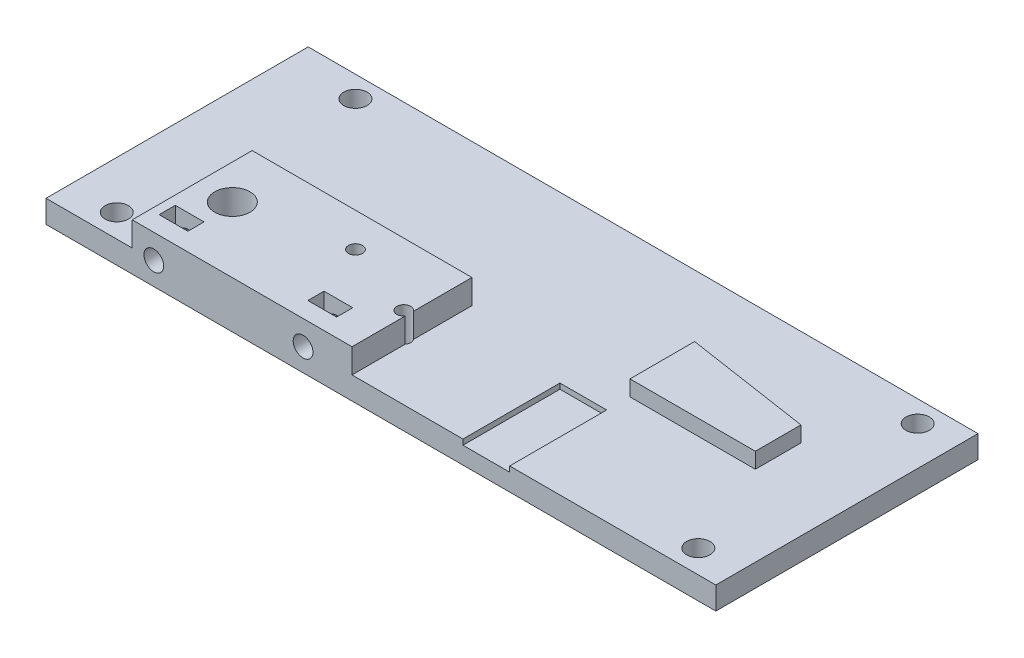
ISO-10303-21;
HEADER;
FILE_DESCRIPTION(('STEP AP214'),'2;1');
FILE_NAME('part.step','',(''),(''),'','','');
FILE_SCHEMA(('AUTOMOTIVE_DESIGN { 1 0 10303 214 1 1 1 1 }'));
ENDSEC;
DATA;
#1=APPLICATION_CONTEXT('core data for automotive mechanical design processes');
#2=APPLICATION_PROTOCOL_DEFINITION('international standard','automotive_design',2000,#1);
#3=PRODUCT_CONTEXT('',#1,'mechanical');
#4=PRODUCT('Part','Part','',(#3));
#5=PRODUCT_RELATED_PRODUCT_CATEGORY('part','',(#4));
#6=PRODUCT_DEFINITION_FORMATION('','',#4);
#7=PRODUCT_DEFINITION_CONTEXT('part definition',#1,'design');
#8=PRODUCT_DEFINITION('design','',#6,#7);
#9=PRODUCT_DEFINITION_SHAPE('','',#8);
#10=(LENGTH_UNIT() NAMED_UNIT(*) SI_UNIT(.MILLI.,.METRE.));
#11=(NAMED_UNIT(*) PLANE_ANGLE_UNIT() SI_UNIT($,.RADIAN.));
#12=(NAMED_UNIT(*) SI_UNIT($,.STERADIAN.) SOLID_ANGLE_UNIT());
#13=UNCERTAINTY_MEASURE_WITH_UNIT(LENGTH_MEASURE(1.E-05),#10,'distance_accuracy_value','');
#14=(GEOMETRIC_REPRESENTATION_CONTEXT(3) GLOBAL_UNCERTAINTY_ASSIGNED_CONTEXT((#13)) GLOBAL_UNIT_ASSIGNED_CONTEXT((#10,
#11,#12)) REPRESENTATION_CONTEXT('',''));
#15=CARTESIAN_POINT('',(0.,0.,0.));
#16=DIRECTION('',(0.,0.,1.));
#17=DIRECTION('',(1.,0.,0.));
#18=AXIS2_PLACEMENT_3D('',#15,#16,#17);
#19=CARTESIAN_POINT('',(-21.675,6.32499999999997,24.5));
#20=DIRECTION('',(0.,0.,1.));
#21=DIRECTION('',(1.,0.,0.));
#22=AXIS2_PLACEMENT_3D('',#19,#20,#21);
#23=CYLINDRICAL_SURFACE('',#22,2.75);
#24=CARTESIAN_POINT('',(-21.675,6.32499999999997,31.5));
#25=DIRECTION('',(0.,0.,1.));
#26=DIRECTION('',(1.,0.,0.));
#27=AXIS2_PLACEMENT_3D('',#24,#25,#26);
#28=CIRCLE('',#27,2.75);
#29=CARTESIAN_POINT('',(-18.925,6.32499999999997,31.5));
#30=VERTEX_POINT('',#29);
#31=EDGE_CURVE('E37',#30,#30,#28,.F.);
#32=ORIENTED_EDGE('',*,*,#31,.T.);
#33=EDGE_LOOP('',(#32));
#34=FACE_BOUND('',#33,.T.);
#35=CARTESIAN_POINT('',(-21.675,6.32499999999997,36.5));
#36=DIRECTION('',(0.,0.,1.));
#37=DIRECTION('',(1.,0.,0.));
#38=AXIS2_PLACEMENT_3D('',#35,#36,#37);
#39=CIRCLE('',#38,2.75);
#40=CARTESIAN_POINT('',(-18.925,6.32499999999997,36.5));
#41=VERTEX_POINT('',#40);
#42=EDGE_CURVE('E327',#41,#41,#39,.T.);
#43=ORIENTED_EDGE('',*,*,#42,.T.);
#44=EDGE_LOOP('',(#43));
#45=FACE_BOUND('',#44,.T.);
#46=ADVANCED_FACE('F33',(#34,#45),#23,.F.);
#47=CARTESIAN_POINT('',(-63.225,6.32499999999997,24.5));
#48=DIRECTION('',(0.,0.,1.));
#49=DIRECTION('',(1.,0.,0.));
#50=AXIS2_PLACEMENT_3D('',#47,#48,#49);
#51=CYLINDRICAL_SURFACE('',#50,2.75);
#52=CARTESIAN_POINT('',(-63.225,6.32499999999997,31.5));
#53=DIRECTION('',(0.,0.,1.));
#54=DIRECTION('',(1.,0.,0.));
#55=AXIS2_PLACEMENT_3D('',#52,#53,#54);
#56=CIRCLE('',#55,2.75);
#57=CARTESIAN_POINT('',(-60.475,6.32499999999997,31.5));
#58=VERTEX_POINT('',#57);
#59=EDGE_CURVE('E464',#58,#58,#56,.F.);
#60=ORIENTED_EDGE('',*,*,#59,.T.);
#61=EDGE_LOOP('',(#60));
#62=FACE_BOUND('',#61,.T.);
#63=CARTESIAN_POINT('',(-63.225,6.32499999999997,36.5));
#64=DIRECTION('',(0.,0.,1.));
#65=DIRECTION('',(1.,0.,0.));
#66=AXIS2_PLACEMENT_3D('',#63,#64,#65);
#67=CIRCLE('',#66,2.75);
#68=CARTESIAN_POINT('',(-60.475,6.32499999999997,36.5));
#69=VERTEX_POINT('',#68);
#70=EDGE_CURVE('E321',#69,#69,#67,.T.);
#71=ORIENTED_EDGE('',*,*,#70,.T.);
#72=EDGE_LOOP('',(#71));
#73=FACE_BOUND('',#72,.T.);
#74=ADVANCED_FACE('F494',(#62,#73),#51,.F.);
#75=CARTESIAN_POINT('',(-8.05000000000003,13.1,36.5));
#76=DIRECTION('',(-1.,0.,0.));
#77=DIRECTION('',(0.,0.,1.));
#78=AXIS2_PLACEMENT_3D('',#75,#76,#77);
#79=PLANE('',#78);
#80=DIRECTION('',(0.,0.,-1.));
#81=VECTOR('',#80,1.);
#82=CARTESIAN_POINT('',(-8.05000000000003,13.1,36.5));
#83=LINE('',#82,#81);
#84=CARTESIAN_POINT('',(-8.05000000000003,13.1,19.3638521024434));
#85=VERTEX_POINT('',#84);
#86=CARTESIAN_POINT('',(-8.05000000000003,13.1,3.1));
#87=VERTEX_POINT('',#86);
#88=EDGE_CURVE('E405',#85,#87,#83,.T.);
#89=ORIENTED_EDGE('',*,*,#88,.F.);
#90=DIRECTION('',(0.,-1.,0.));
#91=VECTOR('',#90,1.);
#92=CARTESIAN_POINT('',(-8.05000000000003,13.1,19.3638521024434));
#93=LINE('',#92,#91);
#94=CARTESIAN_POINT('',(-8.05000000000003,6.3,19.3638521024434));
#95=VERTEX_POINT('',#94);
#96=EDGE_CURVE('E362',#85,#95,#93,.T.);
#97=ORIENTED_EDGE('',*,*,#96,.T.);
#98=DIRECTION('',(0.,0.,-1.));
#99=VECTOR('',#98,1.);
#100=CARTESIAN_POINT('',(-8.05000000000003,6.3,36.5));
#101=LINE('',#100,#99);
#102=CARTESIAN_POINT('',(-8.05000000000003,6.3,3.1));
#103=VERTEX_POINT('',#102);
#104=EDGE_CURVE('E414',#95,#103,#101,.T.);
#105=ORIENTED_EDGE('',*,*,#104,.T.);
#106=DIRECTION('',(0.,-1.,0.));
#107=VECTOR('',#106,1.);
#108=CARTESIAN_POINT('',(-8.05000000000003,13.1,3.1));
#109=LINE('',#108,#107);
#110=EDGE_CURVE('E422',#87,#103,#109,.T.);
#111=ORIENTED_EDGE('',*,*,#110,.F.);
#112=EDGE_LOOP('',(#89,#97,#105,#111));
#113=FACE_BOUND('',#112,.T.);
#114=ADVANCED_FACE('F500',(#113),#79,.F.);
#115=CARTESIAN_POINT('',(0.,6.3,0.));
#116=DIRECTION('',(0.,-1.,0.));
#117=DIRECTION('',(0.,0.,-1.));
#118=AXIS2_PLACEMENT_3D('',#115,#116,#117);
#119=PLANE('',#118);
#120=CARTESIAN_POINT('',(-74.15,6.3,-30.55));
#121=DIRECTION('',(0.,-1.,0.));
#122=DIRECTION('',(0.,0.,-1.));
#123=AXIS2_PLACEMENT_3D('',#120,#121,#122);
#124=CIRCLE('',#123,3.25000000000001);
#125=CARTESIAN_POINT('',(-74.15,6.3,-33.8));
#126=VERTEX_POINT('',#125);
#127=EDGE_CURVE('E374',#126,#126,#124,.T.);
#128=ORIENTED_EDGE('',*,*,#127,.T.);
#129=EDGE_LOOP('',(#128));
#130=FACE_BOUND('',#129,.T.);
#131=CARTESIAN_POINT('',(82.45,6.3,-30.5));
#132=DIRECTION('',(0.,-1.,0.));
#133=DIRECTION('',(0.,0.,-1.));
#134=AXIS2_PLACEMENT_3D('',#131,#132,#133);
#135=CIRCLE('',#134,3.25000000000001);
#136=CARTESIAN_POINT('',(82.45,6.3,-33.75));
#137=VERTEX_POINT('',#136);
#138=EDGE_CURVE('E371',#137,#137,#135,.T.);
#139=ORIENTED_EDGE('',*,*,#138,.T.);
#140=EDGE_LOOP('',(#139));
#141=FACE_BOUND('',#140,.T.);
#142=CARTESIAN_POINT('',(81.925,6.3,30.05));
#143=DIRECTION('',(0.,-1.,0.));
#144=DIRECTION('',(0.,0.,-1.));
#145=AXIS2_PLACEMENT_3D('',#142,#143,#144);
#146=CIRCLE('',#145,3.25000000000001);
#147=CARTESIAN_POINT('',(81.925,6.3,26.8));
#148=VERTEX_POINT('',#147);
#149=EDGE_CURVE('E368',#148,#148,#146,.T.);
#150=ORIENTED_EDGE('',*,*,#149,.T.);
#151=EDGE_LOOP('',(#150));
#152=FACE_BOUND('',#151,.T.);
#153=CARTESIAN_POINT('',(-80.,6.3,30.05));
#154=DIRECTION('',(0.,-1.,0.));
#155=DIRECTION('',(0.,0.,-1.));
#156=AXIS2_PLACEMENT_3D('',#153,#154,#155);
#157=CIRCLE('',#156,3.25000000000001);
#158=CARTESIAN_POINT('',(-80.,6.3,26.8));
#159=VERTEX_POINT('',#158);
#160=EDGE_CURVE('E365',#159,#159,#157,.T.);
#161=ORIENTED_EDGE('',*,*,#160,.T.);
#162=EDGE_LOOP('',(#161));
#163=FACE_BOUND('',#162,.T.);
#164=DIRECTION('',(-1.,0.,0.));
#165=VECTOR('',#164,1.);
#166=CARTESIAN_POINT('',(35.85,6.3,9.5));
#167=LINE('',#166,#165);
#168=CARTESIAN_POINT('',(35.85,6.3,9.5));
#169=VERTEX_POINT('',#168);
#170=CARTESIAN_POINT('',(22.85,6.3,9.5));
#171=VERTEX_POINT('',#170);
#172=EDGE_CURVE('E230',#169,#171,#167,.T.);
#173=ORIENTED_EDGE('',*,*,#172,.F.);
#174=DIRECTION('',(0.,0.,-1.));
#175=VECTOR('',#174,1.);
#176=CARTESIAN_POINT('',(35.85,6.3,36.5));
#177=LINE('',#176,#175);
#178=CARTESIAN_POINT('',(35.85,6.3,36.5));
#179=VERTEX_POINT('',#178);
#180=EDGE_CURVE('E215',#179,#169,#177,.T.);
#181=ORIENTED_EDGE('',*,*,#180,.F.);
#182=DIRECTION('',(1.,0.,0.));
#183=VECTOR('',#182,1.);
#184=CARTESIAN_POINT('',(-93.25,6.3,36.5));
#185=LINE('',#184,#183);
#186=CARTESIAN_POINT('',(93.25,6.3,36.5));
#187=VERTEX_POINT('',#186);
#188=EDGE_CURVE('E440',#179,#187,#185,.T.);
#189=ORIENTED_EDGE('',*,*,#188,.T.);
#190=DIRECTION('',(0.,0.,-1.));
#191=VECTOR('',#190,1.);
#192=CARTESIAN_POINT('',(93.25,6.3,36.5));
#193=LINE('',#192,#191);
#194=CARTESIAN_POINT('',(93.25,6.3,-36.5));
#195=VERTEX_POINT('',#194);
#196=EDGE_CURVE('E432',#187,#195,#193,.T.);
#197=ORIENTED_EDGE('',*,*,#196,.T.);
#198=DIRECTION('',(-1.,0.,0.));
#199=VECTOR('',#198,1.);
#200=CARTESIAN_POINT('',(-93.25,6.3,-36.5));
#201=LINE('',#200,#199);
#202=CARTESIAN_POINT('',(-93.25,6.3,-36.5));
#203=VERTEX_POINT('',#202);
#204=EDGE_CURVE('E435',#195,#203,#201,.T.);
#205=ORIENTED_EDGE('',*,*,#204,.T.);
#206=DIRECTION('',(0.,0.,1.));
#207=VECTOR('',#206,1.);
#208=CARTESIAN_POINT('',(-93.25,6.3,36.5));
#209=LINE('',#208,#207);
#210=CARTESIAN_POINT('',(-93.25,6.3,36.5));
#211=VERTEX_POINT('',#210);
#212=EDGE_CURVE('E438',#203,#211,#209,.T.);
#213=ORIENTED_EDGE('',*,*,#212,.T.);
#214=CARTESIAN_POINT('',(-69.25,6.3,36.5));
#215=VERTEX_POINT('',#214);
#216=EDGE_CURVE('E441',#211,#215,#185,.T.);
#217=ORIENTED_EDGE('',*,*,#216,.T.);
#218=DIRECTION('',(0.,0.,1.));
#219=VECTOR('',#218,1.);
#220=CARTESIAN_POINT('',(-69.25,6.3,36.5));
#221=LINE('',#220,#219);
#222=CARTESIAN_POINT('',(-69.25,6.3,3.1));
#223=VERTEX_POINT('',#222);
#224=EDGE_CURVE('E398',#223,#215,#221,.T.);
#225=ORIENTED_EDGE('',*,*,#224,.F.);
#226=DIRECTION('',(-1.,0.,0.));
#227=VECTOR('',#226,1.);
#228=CARTESIAN_POINT('',(-69.25,6.3,3.1));
#229=LINE('',#228,#227);
#230=EDGE_CURVE('E403',#103,#223,#229,.T.);
#231=ORIENTED_EDGE('',*,*,#230,.F.);
#232=ORIENTED_EDGE('',*,*,#104,.F.);
#233=CARTESIAN_POINT('',(-9.61660000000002,6.3,20.525));
#234=DIRECTION('',(0.,-1.,0.));
#235=DIRECTION('',(0.,0.,-1.));
#236=AXIS2_PLACEMENT_3D('',#233,#234,#235);
#237=CIRCLE('',#236,1.95);
#238=CARTESIAN_POINT('',(-8.05000000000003,6.3,21.6861478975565));
#239=VERTEX_POINT('',#238);
#240=EDGE_CURVE('E359',#95,#239,#237,.T.);
#241=ORIENTED_EDGE('',*,*,#240,.T.);
#242=CARTESIAN_POINT('',(-8.05000000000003,6.3,36.5));
#243=VERTEX_POINT('',#242);
#244=EDGE_CURVE('E415',#243,#239,#101,.T.);
#245=ORIENTED_EDGE('',*,*,#244,.F.);
#246=CARTESIAN_POINT('',(22.85,6.3,36.5));
#247=VERTEX_POINT('',#246);
#248=EDGE_CURVE('E444',#243,#247,#185,.T.);
#249=ORIENTED_EDGE('',*,*,#248,.T.);
#250=DIRECTION('',(0.,0.,1.));
#251=VECTOR('',#250,1.);
#252=CARTESIAN_POINT('',(22.85,6.3,36.5));
#253=LINE('',#252,#251);
#254=EDGE_CURVE('E228',#171,#247,#253,.T.);
#255=ORIENTED_EDGE('',*,*,#254,.F.);
#256=EDGE_LOOP('',(#173,#181,#189,#197,#205,#213,#217,#225,#231,#232,#241,#245,#249,#255));
#257=FACE_BOUND('',#256,.T.);
#258=DIRECTION('',(0.,0.,1.));
#259=VECTOR('',#258,1.);
#260=CARTESIAN_POINT('',(35.95,6.3,-14.9));
#261=LINE('',#260,#259);
#262=CARTESIAN_POINT('',(35.95,6.3,-14.9));
#263=VERTEX_POINT('',#262);
#264=CARTESIAN_POINT('',(35.95,6.3,3.1));
#265=VERTEX_POINT('',#264);
#266=EDGE_CURVE('E377',#263,#265,#261,.T.);
#267=ORIENTED_EDGE('',*,*,#266,.F.);
#268=DIRECTION('',(-0.988664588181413,0.,-0.150141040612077));
#269=VECTOR('',#268,1.);
#270=CARTESIAN_POINT('',(70.85,6.3,-9.6));
#271=LINE('',#270,#269);
#272=CARTESIAN_POINT('',(70.85,6.3,-9.6));
#273=VERTEX_POINT('',#272);
#274=EDGE_CURVE('E382',#273,#263,#271,.T.);
#275=ORIENTED_EDGE('',*,*,#274,.F.);
#276=DIRECTION('',(0.,0.,-1.));
#277=VECTOR('',#276,1.);
#278=CARTESIAN_POINT('',(70.85,6.3,23.1));
#279=LINE('',#278,#277);
#280=CARTESIAN_POINT('',(70.85,6.3,3.1));
#281=VERTEX_POINT('',#280);
#282=EDGE_CURVE('E389',#281,#273,#279,.T.);
#283=ORIENTED_EDGE('',*,*,#282,.F.);
#284=DIRECTION('',(-1.,0.,0.));
#285=VECTOR('',#284,1.);
#286=CARTESIAN_POINT('',(70.85,6.3,3.1));
#287=LINE('',#286,#285);
#288=EDGE_CURVE('E245',#281,#265,#287,.T.);
#289=ORIENTED_EDGE('',*,*,#288,.T.);
#290=EDGE_LOOP('',(#267,#275,#283,#289));
#291=FACE_BOUND('',#290,.T.);
#292=ADVANCED_FACE('F567',(#130,#141,#152,#163,#257,#291),#119,.F.);
#293=CARTESIAN_POINT('',(93.25,6.3,36.5));
#294=DIRECTION('',(-1.,0.,0.));
#295=DIRECTION('',(0.,0.,1.));
#296=AXIS2_PLACEMENT_3D('',#293,#294,#295);
#297=PLANE('',#296);
#298=DIRECTION('',(0.,0.,-1.));
#299=VECTOR('',#298,1.);
#300=CARTESIAN_POINT('',(93.25,0.,36.5));
#301=LINE('',#300,#299);
#302=CARTESIAN_POINT('',(93.25,0.,36.5));
#303=VERTEX_POINT('',#302);
#304=CARTESIAN_POINT('',(93.25,0.,-36.5));
#305=VERTEX_POINT('',#304);
#306=EDGE_CURVE('E431',#303,#305,#301,.T.);
#307=ORIENTED_EDGE('',*,*,#306,.T.);
#308=DIRECTION('',(0.,-1.,0.));
#309=VECTOR('',#308,1.);
#310=CARTESIAN_POINT('',(93.25,6.3,-36.5));
#311=LINE('',#310,#309);
#312=EDGE_CURVE('E42',#195,#305,#311,.T.);
#313=ORIENTED_EDGE('',*,*,#312,.F.);
#314=ORIENTED_EDGE('',*,*,#196,.F.);
#315=DIRECTION('',(0.,-1.,0.));
#316=VECTOR('',#315,1.);
#317=CARTESIAN_POINT('',(93.25,6.3,36.5));
#318=LINE('',#317,#316);
#319=EDGE_CURVE('E443',#187,#303,#318,.T.);
#320=ORIENTED_EDGE('',*,*,#319,.T.);
#321=EDGE_LOOP('',(#307,#313,#314,#320));
#322=FACE_BOUND('',#321,.T.);
#323=ADVANCED_FACE('F35',(#322),#297,.F.);
#324=CARTESIAN_POINT('',(-93.25,6.3,-36.5));
#325=DIRECTION('',(0.,0.,1.));
#326=DIRECTION('',(1.,0.,0.));
#327=AXIS2_PLACEMENT_3D('',#324,#325,#326);
#328=PLANE('',#327);
#329=DIRECTION('',(-1.,0.,0.));
#330=VECTOR('',#329,1.);
#331=CARTESIAN_POINT('',(-93.25,0.,-36.5));
#332=LINE('',#331,#330);
#333=CARTESIAN_POINT('',(-93.25,0.,-36.5));
#334=VERTEX_POINT('',#333);
#335=EDGE_CURVE('E447',#305,#334,#332,.T.);
#336=ORIENTED_EDGE('',*,*,#335,.T.);
#337=DIRECTION('',(0.,-1.,0.));
#338=VECTOR('',#337,1.);
#339=CARTESIAN_POINT('',(-93.25,6.3,-36.5));
#340=LINE('',#339,#338);
#341=EDGE_CURVE('E457',#203,#334,#340,.T.);
#342=ORIENTED_EDGE('',*,*,#341,.F.);
#343=ORIENTED_EDGE('',*,*,#204,.F.);
#344=ORIENTED_EDGE('',*,*,#312,.T.);
#345=EDGE_LOOP('',(#336,#342,#343,#344));
#346=FACE_BOUND('',#345,.T.);
#347=ADVANCED_FACE('F594',(#346),#328,.F.);
#348=CARTESIAN_POINT('',(-93.25,6.3,36.5));
#349=DIRECTION('',(1.,0.,0.));
#350=DIRECTION('',(0.,0.,-1.));
#351=AXIS2_PLACEMENT_3D('',#348,#349,#350);
#352=PLANE('',#351);
#353=DIRECTION('',(0.,0.,1.));
#354=VECTOR('',#353,1.);
#355=CARTESIAN_POINT('',(-93.25,0.,36.5));
#356=LINE('',#355,#354);
#357=CARTESIAN_POINT('',(-93.25,0.,36.5));
#358=VERTEX_POINT('',#357);
#359=EDGE_CURVE('E449',#334,#358,#356,.T.);
#360=ORIENTED_EDGE('',*,*,#359,.T.);
#361=DIRECTION('',(0.,-1.,0.));
#362=VECTOR('',#361,1.);
#363=CARTESIAN_POINT('',(-93.25,6.3,36.5));
#364=LINE('',#363,#362);
#365=EDGE_CURVE('E454',#211,#358,#364,.T.);
#366=ORIENTED_EDGE('',*,*,#365,.F.);
#367=ORIENTED_EDGE('',*,*,#212,.F.);
#368=ORIENTED_EDGE('',*,*,#341,.T.);
#369=EDGE_LOOP('',(#360,#366,#367,#368));
#370=FACE_BOUND('',#369,.T.);
#371=ADVANCED_FACE('F599',(#370),#352,.F.);
#372=CARTESIAN_POINT('',(-93.25,6.3,36.5));
#373=DIRECTION('',(0.,0.,-1.));
#374=DIRECTION('',(-1.,0.,0.));
#375=AXIS2_PLACEMENT_3D('',#372,#373,#374);
#376=PLANE('',#375);
#377=ORIENTED_EDGE('',*,*,#188,.F.);
#378=DIRECTION('',(0.,1.,0.));
#379=VECTOR('',#378,1.);
#380=CARTESIAN_POINT('',(35.85,4.8,36.5));
#381=LINE('',#380,#379);
#382=CARTESIAN_POINT('',(35.85,4.8,36.5));
#383=VERTEX_POINT('',#382);
#384=EDGE_CURVE('E237',#383,#179,#381,.T.);
#385=ORIENTED_EDGE('',*,*,#384,.F.);
#386=DIRECTION('',(1.,0.,0.));
#387=VECTOR('',#386,1.);
#388=CARTESIAN_POINT('',(35.85,4.8,36.5));
#389=LINE('',#388,#387);
#390=CARTESIAN_POINT('',(22.85,4.8,36.5));
#391=VERTEX_POINT('',#390);
#392=EDGE_CURVE('E220',#391,#383,#389,.T.);
#393=ORIENTED_EDGE('',*,*,#392,.F.);
#394=DIRECTION('',(0.,1.,0.));
#395=VECTOR('',#394,1.);
#396=CARTESIAN_POINT('',(22.85,4.8,36.5));
#397=LINE('',#396,#395);
#398=EDGE_CURVE('E240',#391,#247,#397,.T.);
#399=ORIENTED_EDGE('',*,*,#398,.T.);
#400=ORIENTED_EDGE('',*,*,#248,.F.);
#401=DIRECTION('',(0.,-1.,0.));
#402=VECTOR('',#401,1.);
#403=CARTESIAN_POINT('',(-8.05000000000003,13.1,36.5));
#404=LINE('',#403,#402);
#405=CARTESIAN_POINT('',(-8.05000000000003,13.1,36.5));
#406=VERTEX_POINT('',#405);
#407=EDGE_CURVE('E425',#406,#243,#404,.T.);
#408=ORIENTED_EDGE('',*,*,#407,.F.);
#409=DIRECTION('',(1.,0.,0.));
#410=VECTOR('',#409,1.);
#411=CARTESIAN_POINT('',(-69.25,13.1,36.5));
#412=LINE('',#411,#410);
#413=CARTESIAN_POINT('',(-69.25,13.1,36.5));
#414=VERTEX_POINT('',#413);
#415=EDGE_CURVE('E402',#414,#406,#412,.T.);
#416=ORIENTED_EDGE('',*,*,#415,.F.);
#417=DIRECTION('',(0.,-1.,0.));
#418=VECTOR('',#417,1.);
#419=CARTESIAN_POINT('',(-69.25,13.1,36.5));
#420=LINE('',#419,#418);
#421=EDGE_CURVE('E428',#414,#215,#420,.T.);
#422=ORIENTED_EDGE('',*,*,#421,.T.);
#423=ORIENTED_EDGE('',*,*,#216,.F.);
#424=ORIENTED_EDGE('',*,*,#365,.T.);
#425=DIRECTION('',(1.,0.,0.));
#426=VECTOR('',#425,1.);
#427=CARTESIAN_POINT('',(-93.25,0.,36.5));
#428=LINE('',#427,#426);
#429=EDGE_CURVE('E436',#358,#303,#428,.T.);
#430=ORIENTED_EDGE('',*,*,#429,.T.);
#431=ORIENTED_EDGE('',*,*,#319,.F.);
#432=EDGE_LOOP('',(#377,#385,#393,#399,#400,#408,#416,#422,#423,#424,#430,#431));
#433=FACE_BOUND('',#432,.T.);
#434=ORIENTED_EDGE('',*,*,#70,.F.);
#435=EDGE_LOOP('',(#434));
#436=FACE_BOUND('',#435,.T.);
#437=ORIENTED_EDGE('',*,*,#42,.F.);
#438=EDGE_LOOP('',(#437));
#439=FACE_BOUND('',#438,.T.);
#440=ADVANCED_FACE('F584',(#433,#436,#439),#376,.F.);
#441=CARTESIAN_POINT('',(0.,0.,0.));
#442=DIRECTION('',(0.,-1.,0.));
#443=DIRECTION('',(0.,0.,-1.));
#444=AXIS2_PLACEMENT_3D('',#441,#442,#443);
#445=PLANE('',#444);
#446=DIRECTION('',(0.,0.,-1.));
#447=VECTOR('',#446,1.);
#448=CARTESIAN_POINT('',(-66.75,0.,31.5));
#449=LINE('',#448,#447);
#450=CARTESIAN_POINT('',(-66.75,0.,31.5));
#451=VERTEX_POINT('',#450);
#452=CARTESIAN_POINT('',(-66.75,0.,27.));
#453=VERTEX_POINT('',#452);
#454=EDGE_CURVE('E267',#451,#453,#449,.T.);
#455=ORIENTED_EDGE('',*,*,#454,.F.);
#456=DIRECTION('',(-1.,0.,0.));
#457=VECTOR('',#456,1.);
#458=CARTESIAN_POINT('',(-66.75,0.,31.5));
#459=LINE('',#458,#457);
#460=CARTESIAN_POINT('',(-58.75,0.,31.5));
#461=VERTEX_POINT('',#460);
#462=EDGE_CURVE('E257',#461,#451,#459,.T.);
#463=ORIENTED_EDGE('',*,*,#462,.F.);
#464=DIRECTION('',(0.,0.,1.));
#465=VECTOR('',#464,1.);
#466=CARTESIAN_POINT('',(-58.75,0.,31.5));
#467=LINE('',#466,#465);
#468=CARTESIAN_POINT('',(-58.75,0.,27.));
#469=VERTEX_POINT('',#468);
#470=EDGE_CURVE('E273',#469,#461,#467,.T.);
#471=ORIENTED_EDGE('',*,*,#470,.F.);
#472=DIRECTION('',(1.,0.,0.));
#473=VECTOR('',#472,1.);
#474=CARTESIAN_POINT('',(-66.75,0.,27.));
#475=LINE('',#474,#473);
#476=EDGE_CURVE('E269',#453,#469,#475,.T.);
#477=ORIENTED_EDGE('',*,*,#476,.F.);
#478=EDGE_LOOP('',(#455,#463,#471,#477));
#479=FACE_BOUND('',#478,.T.);
#480=DIRECTION('',(0.,0.,-1.));
#481=VECTOR('',#480,1.);
#482=CARTESIAN_POINT('',(-25.35,0.,31.5));
#483=LINE('',#482,#481);
#484=CARTESIAN_POINT('',(-25.35,0.,31.5));
#485=VERTEX_POINT('',#484);
#486=CARTESIAN_POINT('',(-25.35,0.,27.));
#487=VERTEX_POINT('',#486);
#488=EDGE_CURVE('E252',#485,#487,#483,.T.);
#489=ORIENTED_EDGE('',*,*,#488,.F.);
#490=DIRECTION('',(-1.,0.,0.));
#491=VECTOR('',#490,1.);
#492=CARTESIAN_POINT('',(-25.35,0.,31.5));
#493=LINE('',#492,#491);
#494=CARTESIAN_POINT('',(-17.35,0.,31.5));
#495=VERTEX_POINT('',#494);
#496=EDGE_CURVE('E291',#495,#485,#493,.T.);
#497=ORIENTED_EDGE('',*,*,#496,.F.);
#498=DIRECTION('',(0.,0.,1.));
#499=VECTOR('',#498,1.);
#500=CARTESIAN_POINT('',(-17.35,0.,31.5));
#501=LINE('',#500,#499);
#502=CARTESIAN_POINT('',(-17.35,0.,27.));
#503=VERTEX_POINT('',#502);
#504=EDGE_CURVE('E305',#503,#495,#501,.T.);
#505=ORIENTED_EDGE('',*,*,#504,.F.);
#506=DIRECTION('',(1.,0.,0.));
#507=VECTOR('',#506,1.);
#508=CARTESIAN_POINT('',(-25.35,0.,27.));
#509=LINE('',#508,#507);
#510=EDGE_CURVE('E302',#487,#503,#509,.T.);
#511=ORIENTED_EDGE('',*,*,#510,.F.);
#512=EDGE_LOOP('',(#489,#497,#505,#511));
#513=FACE_BOUND('',#512,.T.);
#514=CARTESIAN_POINT('',(-74.15,0.,-30.55));
#515=DIRECTION('',(0.,-1.,0.));
#516=DIRECTION('',(0.,0.,-1.));
#517=AXIS2_PLACEMENT_3D('',#514,#515,#516);
#518=CIRCLE('',#517,3.25000000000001);
#519=CARTESIAN_POINT('',(-74.15,0.,-33.8));
#520=VERTEX_POINT('',#519);
#521=EDGE_CURVE('E339',#520,#520,#518,.T.);
#522=ORIENTED_EDGE('',*,*,#521,.F.);
#523=EDGE_LOOP('',(#522));
#524=FACE_BOUND('',#523,.T.);
#525=CARTESIAN_POINT('',(82.45,0.,-30.5));
#526=DIRECTION('',(0.,-1.,0.));
#527=DIRECTION('',(0.,0.,-1.));
#528=AXIS2_PLACEMENT_3D('',#525,#526,#527);
#529=CIRCLE('',#528,3.25000000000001);
#530=CARTESIAN_POINT('',(82.45,0.,-33.75));
#531=VERTEX_POINT('',#530);
#532=EDGE_CURVE('E343',#531,#531,#529,.T.);
#533=ORIENTED_EDGE('',*,*,#532,.F.);
#534=EDGE_LOOP('',(#533));
#535=FACE_BOUND('',#534,.T.);
#536=CARTESIAN_POINT('',(81.925,0.,30.05));
#537=DIRECTION('',(0.,-1.,0.));
#538=DIRECTION('',(0.,0.,-1.));
#539=AXIS2_PLACEMENT_3D('',#536,#537,#538);
#540=CIRCLE('',#539,3.25000000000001);
#541=CARTESIAN_POINT('',(81.925,0.,26.8));
#542=VERTEX_POINT('',#541);
#543=EDGE_CURVE('E346',#542,#542,#540,.T.);
#544=ORIENTED_EDGE('',*,*,#543,.F.);
#545=EDGE_LOOP('',(#544));
#546=FACE_BOUND('',#545,.T.);
#547=CARTESIAN_POINT('',(-59.6038,0.,18.2644));
#548=DIRECTION('',(0.,-1.,0.));
#549=DIRECTION('',(0.,0.,-1.));
#550=AXIS2_PLACEMENT_3D('',#547,#548,#549);
#551=CIRCLE('',#550,4.92499999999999);
#552=CARTESIAN_POINT('',(-59.6038,0.,13.3394));
#553=VERTEX_POINT('',#552);
#554=EDGE_CURVE('E333',#553,#553,#551,.T.);
#555=ORIENTED_EDGE('',*,*,#554,.F.);
#556=EDGE_LOOP('',(#555));
#557=FACE_BOUND('',#556,.T.);
#558=CARTESIAN_POINT('',(-31.0288,0.,12.5494));
#559=DIRECTION('',(0.,-1.,0.));
#560=DIRECTION('',(0.,0.,-1.));
#561=AXIS2_PLACEMENT_3D('',#558,#559,#560);
#562=CIRCLE('',#561,1.95);
#563=CARTESIAN_POINT('',(-31.0288,0.,10.5994));
#564=VERTEX_POINT('',#563);
#565=EDGE_CURVE('E334',#564,#564,#562,.T.);
#566=ORIENTED_EDGE('',*,*,#565,.F.);
#567=EDGE_LOOP('',(#566));
#568=FACE_BOUND('',#567,.T.);
#569=CARTESIAN_POINT('',(-9.61660000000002,0.,20.525));
#570=DIRECTION('',(0.,-1.,0.));
#571=DIRECTION('',(0.,0.,-1.));
#572=AXIS2_PLACEMENT_3D('',#569,#570,#571);
#573=CIRCLE('',#572,1.95);
#574=CARTESIAN_POINT('',(-9.61660000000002,0.,18.575));
#575=VERTEX_POINT('',#574);
#576=EDGE_CURVE('E320',#575,#575,#573,.T.);
#577=ORIENTED_EDGE('',*,*,#576,.F.);
#578=EDGE_LOOP('',(#577));
#579=FACE_BOUND('',#578,.T.);
#580=CARTESIAN_POINT('',(-80.,0.,30.05));
#581=DIRECTION('',(0.,-1.,0.));
#582=DIRECTION('',(0.,0.,-1.));
#583=AXIS2_PLACEMENT_3D('',#580,#581,#582);
#584=CIRCLE('',#583,3.25000000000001);
#585=CARTESIAN_POINT('',(-80.,0.,26.8));
#586=VERTEX_POINT('',#585);
#587=EDGE_CURVE('E342',#586,#586,#584,.T.);
#588=ORIENTED_EDGE('',*,*,#587,.F.);
#589=EDGE_LOOP('',(#588));
#590=FACE_BOUND('',#589,.T.);
#591=ORIENTED_EDGE('',*,*,#306,.F.);
#592=ORIENTED_EDGE('',*,*,#429,.F.);
#593=ORIENTED_EDGE('',*,*,#359,.F.);
#594=ORIENTED_EDGE('',*,*,#335,.F.);
#595=EDGE_LOOP('',(#591,#592,#593,#594));
#596=FACE_BOUND('',#595,.T.);
#597=ADVANCED_FACE('F541',(#479,#513,#524,#535,#546,#557,#568,#579,#590,#596),#445,.T.);
#598=CARTESIAN_POINT('',(-69.25,13.1,36.5));
#599=DIRECTION('',(1.,0.,0.));
#600=DIRECTION('',(0.,0.,-1.));
#601=AXIS2_PLACEMENT_3D('',#598,#599,#600);
#602=PLANE('',#601);
#603=ORIENTED_EDGE('',*,*,#224,.T.);
#604=ORIENTED_EDGE('',*,*,#421,.F.);
#605=DIRECTION('',(0.,0.,1.));
#606=VECTOR('',#605,1.);
#607=CARTESIAN_POINT('',(-69.25,13.1,36.5));
#608=LINE('',#607,#606);
#609=CARTESIAN_POINT('',(-69.25,13.1,3.1));
#610=VERTEX_POINT('',#609);
#611=EDGE_CURVE('E399',#610,#414,#608,.T.);
#612=ORIENTED_EDGE('',*,*,#611,.F.);
#613=DIRECTION('',(0.,-1.,0.));
#614=VECTOR('',#613,1.);
#615=CARTESIAN_POINT('',(-69.25,13.1,3.1));
#616=LINE('',#615,#614);
#617=EDGE_CURVE('E411',#610,#223,#616,.T.);
#618=ORIENTED_EDGE('',*,*,#617,.T.);
#619=EDGE_LOOP('',(#603,#604,#612,#618));
#620=FACE_BOUND('',#619,.T.);
#621=ADVANCED_FACE('F580',(#620),#602,.F.);
#622=ORIENTED_EDGE('',*,*,#244,.T.);
#623=DIRECTION('',(0.,-1.,0.));
#624=VECTOR('',#623,1.);
#625=CARTESIAN_POINT('',(-8.05000000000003,13.1,21.6861478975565));
#626=LINE('',#625,#624);
#627=CARTESIAN_POINT('',(-8.05000000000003,13.1,21.6861478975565));
#628=VERTEX_POINT('',#627);
#629=EDGE_CURVE('E356',#239,#628,#626,.F.);
#630=ORIENTED_EDGE('',*,*,#629,.T.);
#631=EDGE_CURVE('E406',#406,#628,#83,.T.);
#632=ORIENTED_EDGE('',*,*,#631,.F.);
#633=ORIENTED_EDGE('',*,*,#407,.T.);
#634=EDGE_LOOP('',(#622,#630,#632,#633));
#635=FACE_BOUND('',#634,.T.);
#636=ADVANCED_FACE('F562',(#635),#79,.F.);
#637=CARTESIAN_POINT('',(-69.25,13.1,3.1));
#638=DIRECTION('',(0.,0.,1.));
#639=DIRECTION('',(1.,0.,0.));
#640=AXIS2_PLACEMENT_3D('',#637,#638,#639);
#641=PLANE('',#640);
#642=ORIENTED_EDGE('',*,*,#230,.T.);
#643=ORIENTED_EDGE('',*,*,#617,.F.);
#644=DIRECTION('',(-1.,0.,0.));
#645=VECTOR('',#644,1.);
#646=CARTESIAN_POINT('',(-69.25,13.1,3.1));
#647=LINE('',#646,#645);
#648=EDGE_CURVE('E409',#87,#610,#647,.T.);
#649=ORIENTED_EDGE('',*,*,#648,.F.);
#650=ORIENTED_EDGE('',*,*,#110,.T.);
#651=EDGE_LOOP('',(#642,#643,#649,#650));
#652=FACE_BOUND('',#651,.T.);
#653=ADVANCED_FACE('F551',(#652),#641,.F.);
#654=CARTESIAN_POINT('',(0.,13.1,0.));
#655=DIRECTION('',(0.,-1.,0.));
#656=DIRECTION('',(0.,0.,-1.));
#657=AXIS2_PLACEMENT_3D('',#654,#655,#656);
#658=PLANE('',#657);
#659=DIRECTION('',(-1.,0.,0.));
#660=VECTOR('',#659,1.);
#661=CARTESIAN_POINT('',(-66.75,13.1,31.5));
#662=LINE('',#661,#660);
#663=CARTESIAN_POINT('',(-58.75,13.1,31.5));
#664=VERTEX_POINT('',#663);
#665=CARTESIAN_POINT('',(-66.75,13.1,31.5));
#666=VERTEX_POINT('',#665);
#667=EDGE_CURVE('E263',#664,#666,#662,.T.);
#668=ORIENTED_EDGE('',*,*,#667,.T.);
#669=DIRECTION('',(0.,0.,-1.));
#670=VECTOR('',#669,1.);
#671=CARTESIAN_POINT('',(-66.75,13.1,31.5));
#672=LINE('',#671,#670);
#673=CARTESIAN_POINT('',(-66.75,13.1,27.));
#674=VERTEX_POINT('',#673);
#675=EDGE_CURVE('E253',#666,#674,#672,.T.);
#676=ORIENTED_EDGE('',*,*,#675,.T.);
#677=DIRECTION('',(1.,0.,0.));
#678=VECTOR('',#677,1.);
#679=CARTESIAN_POINT('',(-66.75,13.1,27.));
#680=LINE('',#679,#678);
#681=CARTESIAN_POINT('',(-58.75,13.1,27.));
#682=VERTEX_POINT('',#681);
#683=EDGE_CURVE('E256',#674,#682,#680,.T.);
#684=ORIENTED_EDGE('',*,*,#683,.T.);
#685=DIRECTION('',(0.,0.,1.));
#686=VECTOR('',#685,1.);
#687=CARTESIAN_POINT('',(-58.75,13.1,31.5));
#688=LINE('',#687,#686);
#689=EDGE_CURVE('E260',#682,#664,#688,.T.);
#690=ORIENTED_EDGE('',*,*,#689,.T.);
#691=EDGE_LOOP('',(#668,#676,#684,#690));
#692=FACE_BOUND('',#691,.T.);
#693=DIRECTION('',(-1.,0.,0.));
#694=VECTOR('',#693,1.);
#695=CARTESIAN_POINT('',(-25.35,13.1,31.5));
#696=LINE('',#695,#694);
#697=CARTESIAN_POINT('',(-17.35,13.1,31.5));
#698=VERTEX_POINT('',#697);
#699=CARTESIAN_POINT('',(-25.35,13.1,31.5));
#700=VERTEX_POINT('',#699);
#701=EDGE_CURVE('E297',#698,#700,#696,.T.);
#702=ORIENTED_EDGE('',*,*,#701,.T.);
#703=DIRECTION('',(0.,0.,-1.));
#704=VECTOR('',#703,1.);
#705=CARTESIAN_POINT('',(-25.35,13.1,31.5));
#706=LINE('',#705,#704);
#707=CARTESIAN_POINT('',(-25.35,13.1,27.));
#708=VERTEX_POINT('',#707);
#709=EDGE_CURVE('E287',#700,#708,#706,.T.);
#710=ORIENTED_EDGE('',*,*,#709,.T.);
#711=DIRECTION('',(1.,0.,0.));
#712=VECTOR('',#711,1.);
#713=CARTESIAN_POINT('',(-25.35,13.1,27.));
#714=LINE('',#713,#712);
#715=CARTESIAN_POINT('',(-17.35,13.1,27.));
#716=VERTEX_POINT('',#715);
#717=EDGE_CURVE('E290',#708,#716,#714,.T.);
#718=ORIENTED_EDGE('',*,*,#717,.T.);
#719=DIRECTION('',(0.,0.,1.));
#720=VECTOR('',#719,1.);
#721=CARTESIAN_POINT('',(-17.35,13.1,31.5));
#722=LINE('',#721,#720);
#723=EDGE_CURVE('E294',#716,#698,#722,.T.);
#724=ORIENTED_EDGE('',*,*,#723,.T.);
#725=EDGE_LOOP('',(#702,#710,#718,#724));
#726=FACE_BOUND('',#725,.T.);
#727=CARTESIAN_POINT('',(-59.6038,13.1,18.2644));
#728=DIRECTION('',(0.,-1.,0.));
#729=DIRECTION('',(0.,0.,-1.));
#730=AXIS2_PLACEMENT_3D('',#727,#728,#729);
#731=CIRCLE('',#730,4.92499999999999);
#732=CARTESIAN_POINT('',(-59.6038,13.1,13.3394));
#733=VERTEX_POINT('',#732);
#734=EDGE_CURVE('E349',#733,#733,#731,.T.);
#735=ORIENTED_EDGE('',*,*,#734,.T.);
#736=EDGE_LOOP('',(#735));
#737=FACE_BOUND('',#736,.T.);
#738=CARTESIAN_POINT('',(-31.0288,13.1,12.5494));
#739=DIRECTION('',(0.,-1.,0.));
#740=DIRECTION('',(0.,0.,-1.));
#741=AXIS2_PLACEMENT_3D('',#738,#739,#740);
#742=CIRCLE('',#741,1.95);
#743=CARTESIAN_POINT('',(-31.0288,13.1,10.5994));
#744=VERTEX_POINT('',#743);
#745=EDGE_CURVE('E330',#744,#744,#742,.T.);
#746=ORIENTED_EDGE('',*,*,#745,.T.);
#747=EDGE_LOOP('',(#746));
#748=FACE_BOUND('',#747,.T.);
#749=ORIENTED_EDGE('',*,*,#631,.T.);
#750=CARTESIAN_POINT('',(-9.61660000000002,13.1,20.525));
#751=DIRECTION('',(0.,-1.,0.));
#752=DIRECTION('',(0.,0.,-1.));
#753=AXIS2_PLACEMENT_3D('',#750,#751,#752);
#754=CIRCLE('',#753,1.95);
#755=EDGE_CURVE('E11',#628,#85,#754,.T.);
#756=ORIENTED_EDGE('',*,*,#755,.T.);
#757=ORIENTED_EDGE('',*,*,#88,.T.);
#758=ORIENTED_EDGE('',*,*,#648,.T.);
#759=ORIENTED_EDGE('',*,*,#611,.T.);
#760=ORIENTED_EDGE('',*,*,#415,.T.);
#761=EDGE_LOOP('',(#749,#756,#757,#758,#759,#760));
#762=FACE_BOUND('',#761,.T.);
#763=ADVANCED_FACE('F545',(#692,#726,#737,#748,#762),#658,.F.);
#764=CARTESIAN_POINT('',(35.95,10.65,-14.9));
#765=DIRECTION('',(1.,0.,0.));
#766=DIRECTION('',(0.,0.,-1.));
#767=AXIS2_PLACEMENT_3D('',#764,#765,#766);
#768=PLANE('',#767);
#769=ORIENTED_EDGE('',*,*,#266,.T.);
#770=DIRECTION('',(0.,1.,0.));
#771=VECTOR('',#770,1.);
#772=CARTESIAN_POINT('',(35.95,-33.924495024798,3.1));
#773=LINE('',#772,#771);
#774=CARTESIAN_POINT('',(35.95,10.65,3.1));
#775=VERTEX_POINT('',#774);
#776=EDGE_CURVE('E248',#265,#775,#773,.T.);
#777=ORIENTED_EDGE('',*,*,#776,.T.);
#778=DIRECTION('',(0.,0.,1.));
#779=VECTOR('',#778,1.);
#780=CARTESIAN_POINT('',(35.95,10.65,-14.9));
#781=LINE('',#780,#779);
#782=CARTESIAN_POINT('',(35.95,10.65,-14.9));
#783=VERTEX_POINT('',#782);
#784=EDGE_CURVE('E378',#783,#775,#781,.T.);
#785=ORIENTED_EDGE('',*,*,#784,.F.);
#786=DIRECTION('',(0.,-1.,0.));
#787=VECTOR('',#786,1.);
#788=CARTESIAN_POINT('',(35.95,10.65,-14.9));
#789=LINE('',#788,#787);
#790=EDGE_CURVE('E386',#783,#263,#789,.T.);
#791=ORIENTED_EDGE('',*,*,#790,.T.);
#792=EDGE_LOOP('',(#769,#777,#785,#791));
#793=FACE_BOUND('',#792,.T.);
#794=ADVANCED_FACE('F550',(#793),#768,.F.);
#795=CARTESIAN_POINT('',(70.85,10.65,23.1));
#796=DIRECTION('',(-1.,0.,0.));
#797=DIRECTION('',(0.,0.,1.));
#798=AXIS2_PLACEMENT_3D('',#795,#796,#797);
#799=PLANE('',#798);
#800=DIRECTION('',(0.,0.,-1.));
#801=VECTOR('',#800,1.);
#802=CARTESIAN_POINT('',(70.85,10.65,23.1));
#803=LINE('',#802,#801);
#804=CARTESIAN_POINT('',(70.85,10.65,3.1));
#805=VERTEX_POINT('',#804);
#806=CARTESIAN_POINT('',(70.85,10.65,-9.6));
#807=VERTEX_POINT('',#806);
#808=EDGE_CURVE('E381',#805,#807,#803,.T.);
#809=ORIENTED_EDGE('',*,*,#808,.F.);
#810=DIRECTION('',(0.,1.,0.));
#811=VECTOR('',#810,1.);
#812=CARTESIAN_POINT('',(70.85,-33.924495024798,3.1));
#813=LINE('',#812,#811);
#814=EDGE_CURVE('E58',#281,#805,#813,.T.);
#815=ORIENTED_EDGE('',*,*,#814,.F.);
#816=ORIENTED_EDGE('',*,*,#282,.T.);
#817=DIRECTION('',(0.,-1.,0.));
#818=VECTOR('',#817,1.);
#819=CARTESIAN_POINT('',(70.85,10.65,-9.6));
#820=LINE('',#819,#818);
#821=EDGE_CURVE('E395',#807,#273,#820,.T.);
#822=ORIENTED_EDGE('',*,*,#821,.F.);
#823=EDGE_LOOP('',(#809,#815,#816,#822));
#824=FACE_BOUND('',#823,.T.);
#825=ADVANCED_FACE('F659',(#824),#799,.F.);
#826=CARTESIAN_POINT('',(70.85,10.65,-9.6));
#827=DIRECTION('',(-0.150141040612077,0.,0.988664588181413));
#828=DIRECTION('',(0.988664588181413,0.,0.150141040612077));
#829=AXIS2_PLACEMENT_3D('',#826,#827,#828);
#830=PLANE('',#829);
#831=ORIENTED_EDGE('',*,*,#274,.T.);
#832=ORIENTED_EDGE('',*,*,#790,.F.);
#833=DIRECTION('',(-0.988664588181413,0.,-0.150141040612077));
#834=VECTOR('',#833,1.);
#835=CARTESIAN_POINT('',(70.85,10.65,-9.6));
#836=LINE('',#835,#834);
#837=EDGE_CURVE('E384',#807,#783,#836,.T.);
#838=ORIENTED_EDGE('',*,*,#837,.F.);
#839=ORIENTED_EDGE('',*,*,#821,.T.);
#840=EDGE_LOOP('',(#831,#832,#838,#839));
#841=FACE_BOUND('',#840,.T.);
#842=ADVANCED_FACE('F655',(#841),#830,.F.);
#843=CARTESIAN_POINT('',(0.,10.65,0.));
#844=DIRECTION('',(0.,1.,0.));
#845=DIRECTION('',(0.,0.,1.));
#846=AXIS2_PLACEMENT_3D('',#843,#844,#845);
#847=PLANE('',#846);
#848=DIRECTION('',(-1.,0.,0.));
#849=VECTOR('',#848,1.);
#850=CARTESIAN_POINT('',(70.85,10.65,3.1));
#851=LINE('',#850,#849);
#852=EDGE_CURVE('E239',#805,#775,#851,.T.);
#853=ORIENTED_EDGE('',*,*,#852,.F.);
#854=ORIENTED_EDGE('',*,*,#808,.T.);
#855=ORIENTED_EDGE('',*,*,#837,.T.);
#856=ORIENTED_EDGE('',*,*,#784,.T.);
#857=EDGE_LOOP('',(#853,#854,#855,#856));
#858=FACE_BOUND('',#857,.T.);
#859=ADVANCED_FACE('F652',(#858),#847,.T.);
#860=CARTESIAN_POINT('',(-9.61660000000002,13.1,20.525));
#861=DIRECTION('',(0.,-1.,0.));
#862=DIRECTION('',(0.,0.,-1.));
#863=AXIS2_PLACEMENT_3D('',#860,#861,#862);
#864=CYLINDRICAL_SURFACE('',#863,1.95);
#865=ORIENTED_EDGE('',*,*,#576,.T.);
#866=EDGE_LOOP('',(#865));
#867=FACE_BOUND('',#866,.T.);
#868=ORIENTED_EDGE('',*,*,#755,.F.);
#869=ORIENTED_EDGE('',*,*,#629,.F.);
#870=ORIENTED_EDGE('',*,*,#240,.F.);
#871=ORIENTED_EDGE('',*,*,#96,.F.);
#872=EDGE_LOOP('',(#868,#869,#870,#871));
#873=FACE_BOUND('',#872,.T.);
#874=ADVANCED_FACE('F564',(#867,#873),#864,.F.);
#875=CARTESIAN_POINT('',(-31.0288,13.1,12.5494));
#876=DIRECTION('',(0.,-1.,0.));
#877=DIRECTION('',(0.,0.,-1.));
#878=AXIS2_PLACEMENT_3D('',#875,#876,#877);
#879=CYLINDRICAL_SURFACE('',#878,1.95);
#880=CARTESIAN_POINT('',(-31.0288,13.1,10.5994));
#881=CARTESIAN_POINT('',(-31.0288,12.9635416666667,10.5994));
#882=CARTESIAN_POINT('',(-31.0288,12.8270833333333,10.5994));
#883=CARTESIAN_POINT('',(-31.0288,12.5541666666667,10.5994));
#884=CARTESIAN_POINT('',(-31.0288,12.4177083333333,10.5994));
#885=CARTESIAN_POINT('',(-31.0288,12.1447916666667,10.5994));
#886=CARTESIAN_POINT('',(-31.0288,12.0083333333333,10.5994));
#887=CARTESIAN_POINT('',(-31.0288,11.7354166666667,10.5994));
#888=CARTESIAN_POINT('',(-31.0288,11.5989583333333,10.5994));
#889=CARTESIAN_POINT('',(-31.0288,11.3260416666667,10.5994));
#890=CARTESIAN_POINT('',(-31.0288,11.1895833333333,10.5994));
#891=CARTESIAN_POINT('',(-31.0288,10.9166666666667,10.5994));
#892=CARTESIAN_POINT('',(-31.0288,10.7802083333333,10.5994));
#893=CARTESIAN_POINT('',(-31.0288,10.5072916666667,10.5994));
#894=CARTESIAN_POINT('',(-31.0288,10.3708333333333,10.5994));
#895=CARTESIAN_POINT('',(-31.0288,10.0979166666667,10.5994));
#896=CARTESIAN_POINT('',(-31.0288,9.96145833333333,10.5994));
#897=CARTESIAN_POINT('',(-31.0288,9.68854166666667,10.5994));
#898=CARTESIAN_POINT('',(-31.0288,9.55208333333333,10.5994));
#899=CARTESIAN_POINT('',(-31.0288,9.27916666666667,10.5994));
#900=CARTESIAN_POINT('',(-31.0288,9.14270833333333,10.5994));
#901=CARTESIAN_POINT('',(-31.0288,8.86979166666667,10.5994));
#902=CARTESIAN_POINT('',(-31.0288,8.73333333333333,10.5994));
#903=CARTESIAN_POINT('',(-31.0288,8.46041666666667,10.5994));
#904=CARTESIAN_POINT('',(-31.0288,8.32395833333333,10.5994));
#905=CARTESIAN_POINT('',(-31.0288,8.05104166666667,10.5994));
#906=CARTESIAN_POINT('',(-31.0288,7.91458333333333,10.5994));
#907=CARTESIAN_POINT('',(-31.0288,7.64166666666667,10.5994));
#908=CARTESIAN_POINT('',(-31.0288,7.50520833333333,10.5994));
#909=CARTESIAN_POINT('',(-31.0288,7.23229166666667,10.5994));
#910=CARTESIAN_POINT('',(-31.0288,7.09583333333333,10.5994));
#911=CARTESIAN_POINT('',(-31.0288,6.82291666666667,10.5994));
#912=CARTESIAN_POINT('',(-31.0288,6.68645833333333,10.5994));
#913=CARTESIAN_POINT('',(-31.0288,6.41354166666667,10.5994));
#914=CARTESIAN_POINT('',(-31.0288,6.27708333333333,10.5994));
#915=CARTESIAN_POINT('',(-31.0288,6.00416666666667,10.5994));
#916=CARTESIAN_POINT('',(-31.0288,5.86770833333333,10.5994));
#917=CARTESIAN_POINT('',(-31.0288,5.59479166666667,10.5994));
#918=CARTESIAN_POINT('',(-31.0288,5.45833333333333,10.5994));
#919=CARTESIAN_POINT('',(-31.0288,5.18541666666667,10.5994));
#920=CARTESIAN_POINT('',(-31.0288,5.04895833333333,10.5994));
#921=CARTESIAN_POINT('',(-31.0288,4.77604166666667,10.5994));
#922=CARTESIAN_POINT('',(-31.0288,4.63958333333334,10.5994));
#923=CARTESIAN_POINT('',(-31.0288,4.36666666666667,10.5994));
#924=CARTESIAN_POINT('',(-31.0288,4.23020833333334,10.5994));
#925=CARTESIAN_POINT('',(-31.0288,3.95729166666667,10.5994));
#926=CARTESIAN_POINT('',(-31.0288,3.82083333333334,10.5994));
#927=CARTESIAN_POINT('',(-31.0288,3.54791666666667,10.5994));
#928=CARTESIAN_POINT('',(-31.0288,3.41145833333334,10.5994));
#929=CARTESIAN_POINT('',(-31.0288,3.13854166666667,10.5994));
#930=CARTESIAN_POINT('',(-31.0288,3.00208333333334,10.5994));
#931=CARTESIAN_POINT('',(-31.0288,2.72916666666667,10.5994));
#932=CARTESIAN_POINT('',(-31.0288,2.59270833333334,10.5994));
#933=CARTESIAN_POINT('',(-31.0288,2.31979166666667,10.5994));
#934=CARTESIAN_POINT('',(-31.0288,2.18333333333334,10.5994));
#935=CARTESIAN_POINT('',(-31.0288,1.91041666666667,10.5994));
#936=CARTESIAN_POINT('',(-31.0288,1.77395833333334,10.5994));
#937=CARTESIAN_POINT('',(-31.0288,1.50104166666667,10.5994));
#938=CARTESIAN_POINT('',(-31.0288,1.36458333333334,10.5994));
#939=CARTESIAN_POINT('',(-31.0288,1.09166666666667,10.5994));
#940=CARTESIAN_POINT('',(-31.0288,0.955208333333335,10.5994));
#941=CARTESIAN_POINT('',(-31.0288,0.682291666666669,10.5994));
#942=CARTESIAN_POINT('',(-31.0288,0.545833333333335,10.5994));
#943=CARTESIAN_POINT('',(-31.0288,0.272916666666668,10.5994));
#944=CARTESIAN_POINT('',(-31.0288,0.136458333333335,10.5994));
#945=CARTESIAN_POINT('',(-31.0288,0.,10.5994));
#946=B_SPLINE_CURVE_WITH_KNOTS('',3,(#880,#881,#882,#883,#884,#885,#886,#887,#888,#889,#890,
#891,#892,#893,#894,#895,#896,#897,#898,#899,#900,#901,#902,#903,#904,#905,#906,#907,#908,#909,
#910,#911,#912,#913,#914,#915,#916,#917,#918,#919,#920,#921,#922,#923,#924,#925,#926,#927,#928,
#929,#930,#931,#932,#933,#934,#935,#936,#937,#938,#939,#940,#941,#942,#943,#944,#945),
.UNSPECIFIED.,.F.,.F.,(4,2,2,2,2,2,2,2,2,2,2,2,2,2,2,2,2,2,2,2,2,2,2,2,2,2,2,2,2,2,2,2,4),(0.,
0.409375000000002,0.818750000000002,1.228125,1.6375,2.046875,2.45625,2.865625,3.275,3.684375,
4.09375,4.503125,4.9125,5.321875,5.73125,6.140625,6.55,6.959375,7.36875,7.778125,8.1875,
8.596875,9.00625,9.415625,9.825,10.234375,10.64375,11.053125,11.4625,11.871875,12.28125,
12.690625,13.1),.UNSPECIFIED.);
#947=EDGE_CURVE('BSEAM648',#744,#564,#946,.T.);
#948=ORIENTED_EDGE('',*,*,#745,.F.);
#949=ORIENTED_EDGE('',*,*,#565,.T.);
#950=ORIENTED_EDGE('',*,*,#947,.T.);
#951=ORIENTED_EDGE('',*,*,#947,.F.);
#952=EDGE_LOOP('',(#948,#950,#949,#951));
#953=FACE_BOUND('',#952,.T.);
#954=ADVANCED_FACE('F648',(#953),#879,.F.);
#955=CARTESIAN_POINT('',(-59.6038,13.1,18.2644));
#956=DIRECTION('',(0.,-1.,0.));
#957=DIRECTION('',(0.,0.,-1.));
#958=AXIS2_PLACEMENT_3D('',#955,#956,#957);
#959=CYLINDRICAL_SURFACE('',#958,4.92499999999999);
#960=CARTESIAN_POINT('',(-59.6038,13.1,13.3394));
#961=CARTESIAN_POINT('',(-59.6038,12.9635416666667,13.3394));
#962=CARTESIAN_POINT('',(-59.6038,12.8270833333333,13.3394));
#963=CARTESIAN_POINT('',(-59.6038,12.5541666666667,13.3394));
#964=CARTESIAN_POINT('',(-59.6038,12.4177083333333,13.3394));
#965=CARTESIAN_POINT('',(-59.6038,12.1447916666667,13.3394));
#966=CARTESIAN_POINT('',(-59.6038,12.0083333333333,13.3394));
#967=CARTESIAN_POINT('',(-59.6038,11.7354166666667,13.3394));
#968=CARTESIAN_POINT('',(-59.6038,11.5989583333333,13.3394));
#969=CARTESIAN_POINT('',(-59.6038,11.3260416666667,13.3394));
#970=CARTESIAN_POINT('',(-59.6038,11.1895833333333,13.3394));
#971=CARTESIAN_POINT('',(-59.6038,10.9166666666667,13.3394));
#972=CARTESIAN_POINT('',(-59.6038,10.7802083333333,13.3394));
#973=CARTESIAN_POINT('',(-59.6038,10.5072916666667,13.3394));
#974=CARTESIAN_POINT('',(-59.6038,10.3708333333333,13.3394));
#975=CARTESIAN_POINT('',(-59.6038,10.0979166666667,13.3394));
#976=CARTESIAN_POINT('',(-59.6038,9.96145833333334,13.3394));
#977=CARTESIAN_POINT('',(-59.6038,9.68854166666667,13.3394));
#978=CARTESIAN_POINT('',(-59.6038,9.55208333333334,13.3394));
#979=CARTESIAN_POINT('',(-59.6038,9.27916666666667,13.3394));
#980=CARTESIAN_POINT('',(-59.6038,9.14270833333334,13.3394));
#981=CARTESIAN_POINT('',(-59.6038,8.86979166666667,13.3394));
#982=CARTESIAN_POINT('',(-59.6038,8.73333333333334,13.3394));
#983=CARTESIAN_POINT('',(-59.6038,8.46041666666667,13.3394));
#984=CARTESIAN_POINT('',(-59.6038,8.32395833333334,13.3394));
#985=CARTESIAN_POINT('',(-59.6038,8.05104166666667,13.3394));
#986=CARTESIAN_POINT('',(-59.6038,7.91458333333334,13.3394));
#987=CARTESIAN_POINT('',(-59.6038,7.64166666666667,13.3394));
#988=CARTESIAN_POINT('',(-59.6038,7.50520833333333,13.3394));
#989=CARTESIAN_POINT('',(-59.6038,7.23229166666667,13.3394));
#990=CARTESIAN_POINT('',(-59.6038,7.09583333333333,13.3394));
#991=CARTESIAN_POINT('',(-59.6038,6.82291666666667,13.3394));
#992=CARTESIAN_POINT('',(-59.6038,6.68645833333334,13.3394));
#993=CARTESIAN_POINT('',(-59.6038,6.41354166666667,13.3394));
#994=CARTESIAN_POINT('',(-59.6038,6.27708333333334,13.3394));
#995=CARTESIAN_POINT('',(-59.6038,6.00416666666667,13.3394));
#996=CARTESIAN_POINT('',(-59.6038,5.86770833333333,13.3394));
#997=CARTESIAN_POINT('',(-59.6038,5.59479166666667,13.3394));
#998=CARTESIAN_POINT('',(-59.6038,5.45833333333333,13.3394));
#999=CARTESIAN_POINT('',(-59.6038,5.18541666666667,13.3394));
#1000=CARTESIAN_POINT('',(-59.6038,5.04895833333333,13.3394));
#1001=CARTESIAN_POINT('',(-59.6038,4.77604166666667,13.3394));
#1002=CARTESIAN_POINT('',(-59.6038,4.63958333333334,13.3394));
#1003=CARTESIAN_POINT('',(-59.6038,4.36666666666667,13.3394));
#1004=CARTESIAN_POINT('',(-59.6038,4.23020833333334,13.3394));
#1005=CARTESIAN_POINT('',(-59.6038,3.95729166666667,13.3394));
#1006=CARTESIAN_POINT('',(-59.6038,3.82083333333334,13.3394));
#1007=CARTESIAN_POINT('',(-59.6038,3.54791666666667,13.3394));
#1008=CARTESIAN_POINT('',(-59.6038,3.41145833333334,13.3394));
#1009=CARTESIAN_POINT('',(-59.6038,3.13854166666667,13.3394));
#1010=CARTESIAN_POINT('',(-59.6038,3.00208333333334,13.3394));
#1011=CARTESIAN_POINT('',(-59.6038,2.72916666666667,13.3394));
#1012=CARTESIAN_POINT('',(-59.6038,2.59270833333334,13.3394));
#1013=CARTESIAN_POINT('',(-59.6038,2.31979166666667,13.3394));
#1014=CARTESIAN_POINT('',(-59.6038,2.18333333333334,13.3394));
#1015=CARTESIAN_POINT('',(-59.6038,1.91041666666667,13.3394));
#1016=CARTESIAN_POINT('',(-59.6038,1.77395833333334,13.3394));
#1017=CARTESIAN_POINT('',(-59.6038,1.50104166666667,13.3394));
#1018=CARTESIAN_POINT('',(-59.6038,1.36458333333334,13.3394));
#1019=CARTESIAN_POINT('',(-59.6038,1.09166666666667,13.3394));
#1020=CARTESIAN_POINT('',(-59.6038,0.955208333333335,13.3394));
#1021=CARTESIAN_POINT('',(-59.6038,0.682291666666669,13.3394));
#1022=CARTESIAN_POINT('',(-59.6038,0.545833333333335,13.3394));
#1023=CARTESIAN_POINT('',(-59.6038,0.272916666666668,13.3394));
#1024=CARTESIAN_POINT('',(-59.6038,0.136458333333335,13.3394));
#1025=CARTESIAN_POINT('',(-59.6038,0.,13.3394));
#1026=B_SPLINE_CURVE_WITH_KNOTS('',3,(#960,#961,#962,#963,#964,#965,#966,#967,#968,#969,#970,
#971,#972,#973,#974,#975,#976,#977,#978,#979,#980,#981,#982,#983,#984,#985,#986,#987,#988,#989,
#990,#991,#992,#993,#994,#995,#996,#997,#998,#999,#1000,#1001,#1002,#1003,#1004,#1005,#1006,
#1007,#1008,#1009,#1010,#1011,#1012,#1013,#1014,#1015,#1016,#1017,#1018,#1019,#1020,#1021,#1022,
#1023,#1024,#1025),.UNSPECIFIED.,.F.,.F.,(4,2,2,2,2,2,2,2,2,2,2,2,2,2,2,2,2,2,2,2,2,2,2,2,2,2,2,
2,2,2,2,2,4),(0.,0.409374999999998,0.818749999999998,1.228125,1.6375,2.046875,2.45625,2.865625,
3.275,3.684375,4.09375,4.503125,4.9125,5.321875,5.73125,6.140625,6.55,6.959375,7.36875,7.778125,
8.1875,8.596875,9.00625,9.415625,9.825,10.234375,10.64375,11.053125,11.4625,11.871875,12.28125,
12.690625,13.1),.UNSPECIFIED.);
#1027=EDGE_CURVE('BSEAM638',#733,#553,#1026,.T.);
#1028=ORIENTED_EDGE('',*,*,#734,.F.);
#1029=ORIENTED_EDGE('',*,*,#554,.T.);
#1030=ORIENTED_EDGE('',*,*,#1027,.T.);
#1031=ORIENTED_EDGE('',*,*,#1027,.F.);
#1032=EDGE_LOOP('',(#1028,#1030,#1029,#1031));
#1033=FACE_BOUND('',#1032,.T.);
#1034=ADVANCED_FACE('F638',(#1033),#959,.F.);
#1035=CARTESIAN_POINT('',(-80.,13.1,30.05));
#1036=DIRECTION('',(0.,-1.,0.));
#1037=DIRECTION('',(0.,0.,-1.));
#1038=AXIS2_PLACEMENT_3D('',#1035,#1036,#1037);
#1039=CYLINDRICAL_SURFACE('',#1038,3.25000000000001);
#1040=CARTESIAN_POINT('',(-80.,0.,26.8));
#1041=CARTESIAN_POINT('',(-80.,0.0656250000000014,26.8));
#1042=CARTESIAN_POINT('',(-80.,0.131250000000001,26.8));
#1043=CARTESIAN_POINT('',(-80.,0.262500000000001,26.8));
#1044=CARTESIAN_POINT('',(-80.,0.328125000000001,26.8));
#1045=CARTESIAN_POINT('',(-80.,0.459375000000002,26.8));
#1046=CARTESIAN_POINT('',(-80.,0.525000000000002,26.8));
#1047=CARTESIAN_POINT('',(-80.,0.656250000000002,26.8));
#1048=CARTESIAN_POINT('',(-80.,0.721875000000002,26.8));
#1049=CARTESIAN_POINT('',(-80.,0.853125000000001,26.8));
#1050=CARTESIAN_POINT('',(-80.,0.918750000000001,26.8));
#1051=CARTESIAN_POINT('',(-80.,1.05,26.8));
#1052=CARTESIAN_POINT('',(-80.,1.115625,26.8));
#1053=CARTESIAN_POINT('',(-80.,1.246875,26.8));
#1054=CARTESIAN_POINT('',(-80.,1.3125,26.8));
#1055=CARTESIAN_POINT('',(-80.,1.44375,26.8));
#1056=CARTESIAN_POINT('',(-80.,1.509375,26.8));
#1057=CARTESIAN_POINT('',(-80.,1.640625,26.8));
#1058=CARTESIAN_POINT('',(-80.,1.70625,26.8));
#1059=CARTESIAN_POINT('',(-80.,1.8375,26.8));
#1060=CARTESIAN_POINT('',(-80.,1.903125,26.8));
#1061=CARTESIAN_POINT('',(-80.,2.034375,26.8));
#1062=CARTESIAN_POINT('',(-80.,2.1,26.8));
#1063=CARTESIAN_POINT('',(-80.,2.23125,26.8));
#1064=CARTESIAN_POINT('',(-80.,2.296875,26.8));
#1065=CARTESIAN_POINT('',(-80.,2.428125,26.8));
#1066=CARTESIAN_POINT('',(-80.,2.49375,26.8));
#1067=CARTESIAN_POINT('',(-80.,2.625,26.8));
#1068=CARTESIAN_POINT('',(-80.,2.690625,26.8));
#1069=CARTESIAN_POINT('',(-80.,2.821875,26.8));
#1070=CARTESIAN_POINT('',(-80.,2.8875,26.8));
#1071=CARTESIAN_POINT('',(-80.,3.01875,26.8));
#1072=CARTESIAN_POINT('',(-80.,3.084375,26.8));
#1073=CARTESIAN_POINT('',(-80.,3.215625,26.8));
#1074=CARTESIAN_POINT('',(-80.,3.28125,26.8));
#1075=CARTESIAN_POINT('',(-80.,3.4125,26.8));
#1076=CARTESIAN_POINT('',(-80.,3.478125,26.8));
#1077=CARTESIAN_POINT('',(-80.,3.609375,26.8));
#1078=CARTESIAN_POINT('',(-80.,3.675,26.8));
#1079=CARTESIAN_POINT('',(-80.,3.80625,26.8));
#1080=CARTESIAN_POINT('',(-80.,3.871875,26.8));
#1081=CARTESIAN_POINT('',(-80.,4.003125,26.8));
#1082=CARTESIAN_POINT('',(-80.,4.06875,26.8));
#1083=CARTESIAN_POINT('',(-80.,4.2,26.8));
#1084=CARTESIAN_POINT('',(-80.,4.265625,26.8));
#1085=CARTESIAN_POINT('',(-80.,4.396875,26.8));
#1086=CARTESIAN_POINT('',(-80.,4.4625,26.8));
#1087=CARTESIAN_POINT('',(-80.,4.59375,26.8));
#1088=CARTESIAN_POINT('',(-80.,4.659375,26.8));
#1089=CARTESIAN_POINT('',(-80.,4.790625,26.8));
#1090=CARTESIAN_POINT('',(-80.,4.85625,26.8));
#1091=CARTESIAN_POINT('',(-80.,4.9875,26.8));
#1092=CARTESIAN_POINT('',(-80.,5.053125,26.8));
#1093=CARTESIAN_POINT('',(-80.,5.184375,26.8));
#1094=CARTESIAN_POINT('',(-80.,5.25,26.8));
#1095=CARTESIAN_POINT('',(-80.,5.38125,26.8));
#1096=CARTESIAN_POINT('',(-80.,5.446875,26.8));
#1097=CARTESIAN_POINT('',(-80.,5.578125,26.8));
#1098=CARTESIAN_POINT('',(-80.,5.64375,26.8));
#1099=CARTESIAN_POINT('',(-80.,5.775,26.8));
#1100=CARTESIAN_POINT('',(-80.,5.840625,26.8));
#1101=CARTESIAN_POINT('',(-80.,5.971875,26.8));
#1102=CARTESIAN_POINT('',(-80.,6.0375,26.8));
#1103=CARTESIAN_POINT('',(-80.,6.16875,26.8));
#1104=CARTESIAN_POINT('',(-80.,6.234375,26.8));
#1105=CARTESIAN_POINT('',(-80.,6.3,26.8));
#1106=B_SPLINE_CURVE_WITH_KNOTS('',3,(#1040,#1041,#1042,#1043,#1044,#1045,#1046,#1047,#1048,
#1049,#1050,#1051,#1052,#1053,#1054,#1055,#1056,#1057,#1058,#1059,#1060,#1061,#1062,#1063,#1064,
#1065,#1066,#1067,#1068,#1069,#1070,#1071,#1072,#1073,#1074,#1075,#1076,#1077,#1078,#1079,#1080,
#1081,#1082,#1083,#1084,#1085,#1086,#1087,#1088,#1089,#1090,#1091,#1092,#1093,#1094,#1095,#1096,
#1097,#1098,#1099,#1100,#1101,#1102,#1103,#1104,#1105),.UNSPECIFIED.,.F.,.F.,(4,2,2,2,2,2,2,2,2,
2,2,2,2,2,2,2,2,2,2,2,2,2,2,2,2,2,2,2,2,2,2,2,4),(0.,0.196874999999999,0.39375,
0.590625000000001,0.7875,0.984374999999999,1.18125,1.378125,1.575,1.771875,1.96875,2.165625,
2.3625,2.559375,2.75625,2.953125,3.15,3.346875,3.54375,3.740625,3.9375,4.134375,4.33125,
4.528125,4.725,4.921875,5.11875,5.315625,5.5125,5.709375,5.90625,6.103125,6.3),.UNSPECIFIED.);
#1107=EDGE_CURVE('BSEAM635',#586,#159,#1106,.T.);
#1108=ORIENTED_EDGE('',*,*,#587,.T.);
#1109=ORIENTED_EDGE('',*,*,#160,.F.);
#1110=ORIENTED_EDGE('',*,*,#1107,.T.);
#1111=ORIENTED_EDGE('',*,*,#1107,.F.);
#1112=EDGE_LOOP('',(#1108,#1110,#1109,#1111));
#1113=FACE_BOUND('',#1112,.T.);
#1114=ADVANCED_FACE('F635',(#1113),#1039,.F.);
#1115=CARTESIAN_POINT('',(81.925,13.1,30.05));
#1116=DIRECTION('',(0.,-1.,0.));
#1117=DIRECTION('',(0.,0.,-1.));
#1118=AXIS2_PLACEMENT_3D('',#1115,#1116,#1117);
#1119=CYLINDRICAL_SURFACE('',#1118,3.25000000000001);
#1120=CARTESIAN_POINT('',(81.925,0.,26.8));
#1121=CARTESIAN_POINT('',(81.925,0.0656250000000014,26.8));
#1122=CARTESIAN_POINT('',(81.925,0.131250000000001,26.8));
#1123=CARTESIAN_POINT('',(81.925,0.262500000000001,26.8));
#1124=CARTESIAN_POINT('',(81.925,0.328125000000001,26.8));
#1125=CARTESIAN_POINT('',(81.925,0.459375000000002,26.8));
#1126=CARTESIAN_POINT('',(81.925,0.525000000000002,26.8));
#1127=CARTESIAN_POINT('',(81.925,0.656250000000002,26.8));
#1128=CARTESIAN_POINT('',(81.925,0.721875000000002,26.8));
#1129=CARTESIAN_POINT('',(81.925,0.853125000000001,26.8));
#1130=CARTESIAN_POINT('',(81.925,0.918750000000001,26.8));
#1131=CARTESIAN_POINT('',(81.925,1.05,26.8));
#1132=CARTESIAN_POINT('',(81.925,1.115625,26.8));
#1133=CARTESIAN_POINT('',(81.925,1.246875,26.8));
#1134=CARTESIAN_POINT('',(81.925,1.3125,26.8));
#1135=CARTESIAN_POINT('',(81.925,1.44375,26.8));
#1136=CARTESIAN_POINT('',(81.925,1.509375,26.8));
#1137=CARTESIAN_POINT('',(81.925,1.640625,26.8));
#1138=CARTESIAN_POINT('',(81.925,1.70625,26.8));
#1139=CARTESIAN_POINT('',(81.925,1.8375,26.8));
#1140=CARTESIAN_POINT('',(81.925,1.903125,26.8));
#1141=CARTESIAN_POINT('',(81.925,2.034375,26.8));
#1142=CARTESIAN_POINT('',(81.925,2.1,26.8));
#1143=CARTESIAN_POINT('',(81.925,2.23125,26.8));
#1144=CARTESIAN_POINT('',(81.925,2.296875,26.8));
#1145=CARTESIAN_POINT('',(81.925,2.428125,26.8));
#1146=CARTESIAN_POINT('',(81.925,2.49375,26.8));
#1147=CARTESIAN_POINT('',(81.925,2.625,26.8));
#1148=CARTESIAN_POINT('',(81.925,2.690625,26.8));
#1149=CARTESIAN_POINT('',(81.925,2.821875,26.8));
#1150=CARTESIAN_POINT('',(81.925,2.8875,26.8));
#1151=CARTESIAN_POINT('',(81.925,3.01875,26.8));
#1152=CARTESIAN_POINT('',(81.925,3.084375,26.8));
#1153=CARTESIAN_POINT('',(81.925,3.215625,26.8));
#1154=CARTESIAN_POINT('',(81.925,3.28125,26.8));
#1155=CARTESIAN_POINT('',(81.925,3.4125,26.8));
#1156=CARTESIAN_POINT('',(81.925,3.478125,26.8));
#1157=CARTESIAN_POINT('',(81.925,3.609375,26.8));
#1158=CARTESIAN_POINT('',(81.925,3.675,26.8));
#1159=CARTESIAN_POINT('',(81.925,3.80625,26.8));
#1160=CARTESIAN_POINT('',(81.925,3.871875,26.8));
#1161=CARTESIAN_POINT('',(81.925,4.003125,26.8));
#1162=CARTESIAN_POINT('',(81.925,4.06875,26.8));
#1163=CARTESIAN_POINT('',(81.925,4.2,26.8));
#1164=CARTESIAN_POINT('',(81.925,4.265625,26.8));
#1165=CARTESIAN_POINT('',(81.925,4.396875,26.8));
#1166=CARTESIAN_POINT('',(81.925,4.4625,26.8));
#1167=CARTESIAN_POINT('',(81.925,4.59375,26.8));
#1168=CARTESIAN_POINT('',(81.925,4.659375,26.8));
#1169=CARTESIAN_POINT('',(81.925,4.790625,26.8));
#1170=CARTESIAN_POINT('',(81.925,4.85625,26.8));
#1171=CARTESIAN_POINT('',(81.925,4.9875,26.8));
#1172=CARTESIAN_POINT('',(81.925,5.053125,26.8));
#1173=CARTESIAN_POINT('',(81.925,5.184375,26.8));
#1174=CARTESIAN_POINT('',(81.925,5.25,26.8));
#1175=CARTESIAN_POINT('',(81.925,5.38125,26.8));
#1176=CARTESIAN_POINT('',(81.925,5.446875,26.8));
#1177=CARTESIAN_POINT('',(81.925,5.578125,26.8));
#1178=CARTESIAN_POINT('',(81.925,5.64375,26.8));
#1179=CARTESIAN_POINT('',(81.925,5.775,26.8));
#1180=CARTESIAN_POINT('',(81.925,5.840625,26.8));
#1181=CARTESIAN_POINT('',(81.925,5.971875,26.8));
#1182=CARTESIAN_POINT('',(81.925,6.0375,26.8));
#1183=CARTESIAN_POINT('',(81.925,6.16875,26.8));
#1184=CARTESIAN_POINT('',(81.925,6.234375,26.8));
#1185=CARTESIAN_POINT('',(81.925,6.3,26.8));
#1186=B_SPLINE_CURVE_WITH_KNOTS('',3,(#1120,#1121,#1122,#1123,#1124,#1125,#1126,#1127,#1128,
#1129,#1130,#1131,#1132,#1133,#1134,#1135,#1136,#1137,#1138,#1139,#1140,#1141,#1142,#1143,#1144,
#1145,#1146,#1147,#1148,#1149,#1150,#1151,#1152,#1153,#1154,#1155,#1156,#1157,#1158,#1159,#1160,
#1161,#1162,#1163,#1164,#1165,#1166,#1167,#1168,#1169,#1170,#1171,#1172,#1173,#1174,#1175,#1176,
#1177,#1178,#1179,#1180,#1181,#1182,#1183,#1184,#1185),.UNSPECIFIED.,.F.,.F.,(4,2,2,2,2,2,2,2,2,
2,2,2,2,2,2,2,2,2,2,2,2,2,2,2,2,2,2,2,2,2,2,2,4),(0.,0.196874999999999,0.39375,
0.590625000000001,0.7875,0.984374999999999,1.18125,1.378125,1.575,1.771875,1.96875,2.165625,
2.3625,2.559375,2.75625,2.953125,3.15,3.346875,3.54375,3.740625,3.9375,4.134375,4.33125,
4.528125,4.725,4.921875,5.11875,5.315625,5.5125,5.709375,5.90625,6.103125,6.3),.UNSPECIFIED.);
#1187=EDGE_CURVE('BSEAM637',#542,#148,#1186,.T.);
#1188=ORIENTED_EDGE('',*,*,#543,.T.);
#1189=ORIENTED_EDGE('',*,*,#149,.F.);
#1190=ORIENTED_EDGE('',*,*,#1187,.T.);
#1191=ORIENTED_EDGE('',*,*,#1187,.F.);
#1192=EDGE_LOOP('',(#1188,#1190,#1189,#1191));
#1193=FACE_BOUND('',#1192,.T.);
#1194=ADVANCED_FACE('F637',(#1193),#1119,.F.);
#1195=CARTESIAN_POINT('',(82.45,13.1,-30.5));
#1196=DIRECTION('',(0.,-1.,0.));
#1197=DIRECTION('',(0.,0.,-1.));
#1198=AXIS2_PLACEMENT_3D('',#1195,#1196,#1197);
#1199=CYLINDRICAL_SURFACE('',#1198,3.25000000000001);
#1200=CARTESIAN_POINT('',(82.45,0.,-33.75));
#1201=CARTESIAN_POINT('',(82.45,0.0656250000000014,-33.75));
#1202=CARTESIAN_POINT('',(82.45,0.131250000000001,-33.75));
#1203=CARTESIAN_POINT('',(82.45,0.262500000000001,-33.75));
#1204=CARTESIAN_POINT('',(82.45,0.328125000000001,-33.75));
#1205=CARTESIAN_POINT('',(82.45,0.459375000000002,-33.75));
#1206=CARTESIAN_POINT('',(82.45,0.525000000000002,-33.75));
#1207=CARTESIAN_POINT('',(82.45,0.656250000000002,-33.75));
#1208=CARTESIAN_POINT('',(82.45,0.721875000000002,-33.75));
#1209=CARTESIAN_POINT('',(82.45,0.853125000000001,-33.75));
#1210=CARTESIAN_POINT('',(82.45,0.918750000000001,-33.75));
#1211=CARTESIAN_POINT('',(82.45,1.05,-33.75));
#1212=CARTESIAN_POINT('',(82.45,1.115625,-33.75));
#1213=CARTESIAN_POINT('',(82.45,1.246875,-33.75));
#1214=CARTESIAN_POINT('',(82.45,1.3125,-33.75));
#1215=CARTESIAN_POINT('',(82.45,1.44375,-33.75));
#1216=CARTESIAN_POINT('',(82.45,1.509375,-33.75));
#1217=CARTESIAN_POINT('',(82.45,1.640625,-33.75));
#1218=CARTESIAN_POINT('',(82.45,1.70625,-33.75));
#1219=CARTESIAN_POINT('',(82.45,1.8375,-33.75));
#1220=CARTESIAN_POINT('',(82.45,1.903125,-33.75));
#1221=CARTESIAN_POINT('',(82.45,2.034375,-33.75));
#1222=CARTESIAN_POINT('',(82.45,2.1,-33.75));
#1223=CARTESIAN_POINT('',(82.45,2.23125,-33.75));
#1224=CARTESIAN_POINT('',(82.45,2.296875,-33.75));
#1225=CARTESIAN_POINT('',(82.45,2.428125,-33.75));
#1226=CARTESIAN_POINT('',(82.45,2.49375,-33.75));
#1227=CARTESIAN_POINT('',(82.45,2.625,-33.75));
#1228=CARTESIAN_POINT('',(82.45,2.690625,-33.75));
#1229=CARTESIAN_POINT('',(82.45,2.821875,-33.75));
#1230=CARTESIAN_POINT('',(82.45,2.8875,-33.75));
#1231=CARTESIAN_POINT('',(82.45,3.01875,-33.75));
#1232=CARTESIAN_POINT('',(82.45,3.084375,-33.75));
#1233=CARTESIAN_POINT('',(82.45,3.215625,-33.75));
#1234=CARTESIAN_POINT('',(82.45,3.28125,-33.75));
#1235=CARTESIAN_POINT('',(82.45,3.4125,-33.75));
#1236=CARTESIAN_POINT('',(82.45,3.478125,-33.75));
#1237=CARTESIAN_POINT('',(82.45,3.609375,-33.75));
#1238=CARTESIAN_POINT('',(82.45,3.675,-33.75));
#1239=CARTESIAN_POINT('',(82.45,3.80625,-33.75));
#1240=CARTESIAN_POINT('',(82.45,3.871875,-33.75));
#1241=CARTESIAN_POINT('',(82.45,4.003125,-33.75));
#1242=CARTESIAN_POINT('',(82.45,4.06875,-33.75));
#1243=CARTESIAN_POINT('',(82.45,4.2,-33.75));
#1244=CARTESIAN_POINT('',(82.45,4.265625,-33.75));
#1245=CARTESIAN_POINT('',(82.45,4.396875,-33.75));
#1246=CARTESIAN_POINT('',(82.45,4.4625,-33.75));
#1247=CARTESIAN_POINT('',(82.45,4.59375,-33.75));
#1248=CARTESIAN_POINT('',(82.45,4.659375,-33.75));
#1249=CARTESIAN_POINT('',(82.45,4.790625,-33.75));
#1250=CARTESIAN_POINT('',(82.45,4.85625,-33.75));
#1251=CARTESIAN_POINT('',(82.45,4.9875,-33.75));
#1252=CARTESIAN_POINT('',(82.45,5.053125,-33.75));
#1253=CARTESIAN_POINT('',(82.45,5.184375,-33.75));
#1254=CARTESIAN_POINT('',(82.45,5.25,-33.75));
#1255=CARTESIAN_POINT('',(82.45,5.38125,-33.75));
#1256=CARTESIAN_POINT('',(82.45,5.446875,-33.75));
#1257=CARTESIAN_POINT('',(82.45,5.578125,-33.75));
#1258=CARTESIAN_POINT('',(82.45,5.64375,-33.75));
#1259=CARTESIAN_POINT('',(82.45,5.775,-33.75));
#1260=CARTESIAN_POINT('',(82.45,5.840625,-33.75));
#1261=CARTESIAN_POINT('',(82.45,5.971875,-33.75));
#1262=CARTESIAN_POINT('',(82.45,6.0375,-33.75));
#1263=CARTESIAN_POINT('',(82.45,6.16875,-33.75));
#1264=CARTESIAN_POINT('',(82.45,6.234375,-33.75));
#1265=CARTESIAN_POINT('',(82.45,6.3,-33.75));
#1266=B_SPLINE_CURVE_WITH_KNOTS('',3,(#1200,#1201,#1202,#1203,#1204,#1205,#1206,#1207,#1208,
#1209,#1210,#1211,#1212,#1213,#1214,#1215,#1216,#1217,#1218,#1219,#1220,#1221,#1222,#1223,#1224,
#1225,#1226,#1227,#1228,#1229,#1230,#1231,#1232,#1233,#1234,#1235,#1236,#1237,#1238,#1239,#1240,
#1241,#1242,#1243,#1244,#1245,#1246,#1247,#1248,#1249,#1250,#1251,#1252,#1253,#1254,#1255,#1256,
#1257,#1258,#1259,#1260,#1261,#1262,#1263,#1264,#1265),.UNSPECIFIED.,.F.,.F.,(4,2,2,2,2,2,2,2,2,
2,2,2,2,2,2,2,2,2,2,2,2,2,2,2,2,2,2,2,2,2,2,2,4),(0.,0.196874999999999,0.39375,
0.590625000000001,0.7875,0.984374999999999,1.18125,1.378125,1.575,1.771875,1.96875,2.165625,
2.3625,2.559375,2.75625,2.953125,3.15,3.346875,3.54375,3.740625,3.9375,4.134375,4.33125,
4.528125,4.725,4.921875,5.11875,5.315625,5.5125,5.709375,5.90625,6.103125,6.3),.UNSPECIFIED.);
#1267=EDGE_CURVE('BSEAM645',#531,#137,#1266,.T.);
#1268=ORIENTED_EDGE('',*,*,#532,.T.);
#1269=ORIENTED_EDGE('',*,*,#138,.F.);
#1270=ORIENTED_EDGE('',*,*,#1267,.T.);
#1271=ORIENTED_EDGE('',*,*,#1267,.F.);
#1272=EDGE_LOOP('',(#1268,#1270,#1269,#1271));
#1273=FACE_BOUND('',#1272,.T.);
#1274=ADVANCED_FACE('F645',(#1273),#1199,.F.);
#1275=CARTESIAN_POINT('',(-74.15,13.1,-30.55));
#1276=DIRECTION('',(0.,-1.,0.));
#1277=DIRECTION('',(0.,0.,-1.));
#1278=AXIS2_PLACEMENT_3D('',#1275,#1276,#1277);
#1279=CYLINDRICAL_SURFACE('',#1278,3.25000000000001);
#1280=CARTESIAN_POINT('',(-74.15,0.,-33.8));
#1281=CARTESIAN_POINT('',(-74.15,0.0656250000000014,-33.8));
#1282=CARTESIAN_POINT('',(-74.15,0.131250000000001,-33.8));
#1283=CARTESIAN_POINT('',(-74.15,0.262500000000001,-33.8));
#1284=CARTESIAN_POINT('',(-74.15,0.328125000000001,-33.8));
#1285=CARTESIAN_POINT('',(-74.15,0.459375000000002,-33.8));
#1286=CARTESIAN_POINT('',(-74.15,0.525000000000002,-33.8));
#1287=CARTESIAN_POINT('',(-74.15,0.656250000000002,-33.8));
#1288=CARTESIAN_POINT('',(-74.15,0.721875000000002,-33.8));
#1289=CARTESIAN_POINT('',(-74.15,0.853125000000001,-33.8));
#1290=CARTESIAN_POINT('',(-74.15,0.918750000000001,-33.8));
#1291=CARTESIAN_POINT('',(-74.15,1.05,-33.8));
#1292=CARTESIAN_POINT('',(-74.15,1.115625,-33.8));
#1293=CARTESIAN_POINT('',(-74.15,1.246875,-33.8));
#1294=CARTESIAN_POINT('',(-74.15,1.3125,-33.8));
#1295=CARTESIAN_POINT('',(-74.15,1.44375,-33.8));
#1296=CARTESIAN_POINT('',(-74.15,1.509375,-33.8));
#1297=CARTESIAN_POINT('',(-74.15,1.640625,-33.8));
#1298=CARTESIAN_POINT('',(-74.15,1.70625,-33.8));
#1299=CARTESIAN_POINT('',(-74.15,1.8375,-33.8));
#1300=CARTESIAN_POINT('',(-74.15,1.903125,-33.8));
#1301=CARTESIAN_POINT('',(-74.15,2.034375,-33.8));
#1302=CARTESIAN_POINT('',(-74.15,2.1,-33.8));
#1303=CARTESIAN_POINT('',(-74.15,2.23125,-33.8));
#1304=CARTESIAN_POINT('',(-74.15,2.296875,-33.8));
#1305=CARTESIAN_POINT('',(-74.15,2.428125,-33.8));
#1306=CARTESIAN_POINT('',(-74.15,2.49375,-33.8));
#1307=CARTESIAN_POINT('',(-74.15,2.625,-33.8));
#1308=CARTESIAN_POINT('',(-74.15,2.690625,-33.8));
#1309=CARTESIAN_POINT('',(-74.15,2.821875,-33.8));
#1310=CARTESIAN_POINT('',(-74.15,2.8875,-33.8));
#1311=CARTESIAN_POINT('',(-74.15,3.01875,-33.8));
#1312=CARTESIAN_POINT('',(-74.15,3.084375,-33.8));
#1313=CARTESIAN_POINT('',(-74.15,3.215625,-33.8));
#1314=CARTESIAN_POINT('',(-74.15,3.28125,-33.8));
#1315=CARTESIAN_POINT('',(-74.15,3.4125,-33.8));
#1316=CARTESIAN_POINT('',(-74.15,3.478125,-33.8));
#1317=CARTESIAN_POINT('',(-74.15,3.609375,-33.8));
#1318=CARTESIAN_POINT('',(-74.15,3.675,-33.8));
#1319=CARTESIAN_POINT('',(-74.15,3.80625,-33.8));
#1320=CARTESIAN_POINT('',(-74.15,3.871875,-33.8));
#1321=CARTESIAN_POINT('',(-74.15,4.003125,-33.8));
#1322=CARTESIAN_POINT('',(-74.15,4.06875,-33.8));
#1323=CARTESIAN_POINT('',(-74.15,4.2,-33.8));
#1324=CARTESIAN_POINT('',(-74.15,4.265625,-33.8));
#1325=CARTESIAN_POINT('',(-74.15,4.396875,-33.8));
#1326=CARTESIAN_POINT('',(-74.15,4.4625,-33.8));
#1327=CARTESIAN_POINT('',(-74.15,4.59375,-33.8));
#1328=CARTESIAN_POINT('',(-74.15,4.659375,-33.8));
#1329=CARTESIAN_POINT('',(-74.15,4.790625,-33.8));
#1330=CARTESIAN_POINT('',(-74.15,4.85625,-33.8));
#1331=CARTESIAN_POINT('',(-74.15,4.9875,-33.8));
#1332=CARTESIAN_POINT('',(-74.15,5.053125,-33.8));
#1333=CARTESIAN_POINT('',(-74.15,5.184375,-33.8));
#1334=CARTESIAN_POINT('',(-74.15,5.25,-33.8));
#1335=CARTESIAN_POINT('',(-74.15,5.38125,-33.8));
#1336=CARTESIAN_POINT('',(-74.15,5.446875,-33.8));
#1337=CARTESIAN_POINT('',(-74.15,5.578125,-33.8));
#1338=CARTESIAN_POINT('',(-74.15,5.64375,-33.8));
#1339=CARTESIAN_POINT('',(-74.15,5.775,-33.8));
#1340=CARTESIAN_POINT('',(-74.15,5.840625,-33.8));
#1341=CARTESIAN_POINT('',(-74.15,5.971875,-33.8));
#1342=CARTESIAN_POINT('',(-74.15,6.0375,-33.8));
#1343=CARTESIAN_POINT('',(-74.15,6.16875,-33.8));
#1344=CARTESIAN_POINT('',(-74.15,6.234375,-33.8));
#1345=CARTESIAN_POINT('',(-74.15,6.3,-33.8));
#1346=B_SPLINE_CURVE_WITH_KNOTS('',3,(#1280,#1281,#1282,#1283,#1284,#1285,#1286,#1287,#1288,
#1289,#1290,#1291,#1292,#1293,#1294,#1295,#1296,#1297,#1298,#1299,#1300,#1301,#1302,#1303,#1304,
#1305,#1306,#1307,#1308,#1309,#1310,#1311,#1312,#1313,#1314,#1315,#1316,#1317,#1318,#1319,#1320,
#1321,#1322,#1323,#1324,#1325,#1326,#1327,#1328,#1329,#1330,#1331,#1332,#1333,#1334,#1335,#1336,
#1337,#1338,#1339,#1340,#1341,#1342,#1343,#1344,#1345),.UNSPECIFIED.,.F.,.F.,(4,2,2,2,2,2,2,2,2,
2,2,2,2,2,2,2,2,2,2,2,2,2,2,2,2,2,2,2,2,2,2,2,4),(0.,0.196874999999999,0.39375,
0.590625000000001,0.7875,0.984374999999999,1.18125,1.378125,1.575,1.771875,1.96875,2.165625,
2.3625,2.559375,2.75625,2.953125,3.15,3.346875,3.54375,3.740625,3.9375,4.134375,4.33125,
4.528125,4.725,4.921875,5.11875,5.315625,5.5125,5.709375,5.90625,6.103125,6.3),.UNSPECIFIED.);
#1347=EDGE_CURVE('BSEAM744',#520,#126,#1346,.T.);
#1348=ORIENTED_EDGE('',*,*,#521,.T.);
#1349=ORIENTED_EDGE('',*,*,#127,.F.);
#1350=ORIENTED_EDGE('',*,*,#1347,.T.);
#1351=ORIENTED_EDGE('',*,*,#1347,.F.);
#1352=EDGE_LOOP('',(#1348,#1350,#1349,#1351));
#1353=FACE_BOUND('',#1352,.T.);
#1354=ADVANCED_FACE('F744',(#1353),#1279,.F.);
#1355=CARTESIAN_POINT('',(-66.75,13.1,31.5));
#1356=DIRECTION('',(0.,0.,1.));
#1357=DIRECTION('',(1.,0.,0.));
#1358=AXIS2_PLACEMENT_3D('',#1355,#1356,#1357);
#1359=PLANE('',#1358);
#1360=ORIENTED_EDGE('',*,*,#462,.T.);
#1361=DIRECTION('',(0.,-1.,0.));
#1362=VECTOR('',#1361,1.);
#1363=CARTESIAN_POINT('',(-66.75,13.1,31.5));
#1364=LINE('',#1363,#1362);
#1365=EDGE_CURVE('E278',#666,#451,#1364,.T.);
#1366=ORIENTED_EDGE('',*,*,#1365,.F.);
#1367=ORIENTED_EDGE('',*,*,#667,.F.);
#1368=DIRECTION('',(0.,-1.,0.));
#1369=VECTOR('',#1368,1.);
#1370=CARTESIAN_POINT('',(-58.75,13.1,31.5));
#1371=LINE('',#1370,#1369);
#1372=EDGE_CURVE('E281',#664,#461,#1371,.T.);
#1373=ORIENTED_EDGE('',*,*,#1372,.T.);
#1374=EDGE_LOOP('',(#1360,#1366,#1367,#1373));
#1375=FACE_BOUND('',#1374,.T.);
#1376=ORIENTED_EDGE('',*,*,#59,.F.);
#1377=EDGE_LOOP('',(#1376));
#1378=FACE_BOUND('',#1377,.T.);
#1379=ADVANCED_FACE('F753',(#1375,#1378),#1359,.F.);
#1380=CARTESIAN_POINT('',(-66.75,13.1,27.));
#1381=DIRECTION('',(0.,0.,-1.));
#1382=DIRECTION('',(-1.,0.,0.));
#1383=AXIS2_PLACEMENT_3D('',#1380,#1381,#1382);
#1384=PLANE('',#1383);
#1385=ORIENTED_EDGE('',*,*,#476,.T.);
#1386=DIRECTION('',(0.,-1.,0.));
#1387=VECTOR('',#1386,1.);
#1388=CARTESIAN_POINT('',(-58.75,13.1,27.));
#1389=LINE('',#1388,#1387);
#1390=EDGE_CURVE('E283',#682,#469,#1389,.T.);
#1391=ORIENTED_EDGE('',*,*,#1390,.F.);
#1392=ORIENTED_EDGE('',*,*,#683,.F.);
#1393=DIRECTION('',(0.,-1.,0.));
#1394=VECTOR('',#1393,1.);
#1395=CARTESIAN_POINT('',(-66.75,13.1,27.));
#1396=LINE('',#1395,#1394);
#1397=EDGE_CURVE('E266',#674,#453,#1396,.T.);
#1398=ORIENTED_EDGE('',*,*,#1397,.T.);
#1399=EDGE_LOOP('',(#1385,#1391,#1392,#1398));
#1400=FACE_BOUND('',#1399,.T.);
#1401=CARTESIAN_POINT('',(-63.225,6.32499999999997,27.));
#1402=DIRECTION('',(0.,0.,-1.));
#1403=DIRECTION('',(-1.,0.,0.));
#1404=AXIS2_PLACEMENT_3D('',#1401,#1402,#1403);
#1405=CIRCLE('',#1404,2.75);
#1406=CARTESIAN_POINT('',(-65.975,6.32499999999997,27.));
#1407=VERTEX_POINT('',#1406);
#1408=EDGE_CURVE('E280',#1407,#1407,#1405,.F.);
#1409=ORIENTED_EDGE('',*,*,#1408,.F.);
#1410=EDGE_LOOP('',(#1409));
#1411=FACE_BOUND('',#1410,.T.);
#1412=ADVANCED_FACE('F856',(#1400,#1411),#1384,.F.);
#1413=CARTESIAN_POINT('',(-66.75,13.1,31.5));
#1414=DIRECTION('',(-1.,0.,0.));
#1415=DIRECTION('',(0.,0.,1.));
#1416=AXIS2_PLACEMENT_3D('',#1413,#1414,#1415);
#1417=PLANE('',#1416);
#1418=ORIENTED_EDGE('',*,*,#454,.T.);
#1419=ORIENTED_EDGE('',*,*,#1397,.F.);
#1420=ORIENTED_EDGE('',*,*,#675,.F.);
#1421=ORIENTED_EDGE('',*,*,#1365,.T.);
#1422=EDGE_LOOP('',(#1418,#1419,#1420,#1421));
#1423=FACE_BOUND('',#1422,.T.);
#1424=ADVANCED_FACE('F488',(#1423),#1417,.F.);
#1425=CARTESIAN_POINT('',(-58.75,13.1,31.5));
#1426=DIRECTION('',(1.,0.,0.));
#1427=DIRECTION('',(0.,0.,-1.));
#1428=AXIS2_PLACEMENT_3D('',#1425,#1426,#1427);
#1429=PLANE('',#1428);
#1430=ORIENTED_EDGE('',*,*,#470,.T.);
#1431=ORIENTED_EDGE('',*,*,#1372,.F.);
#1432=ORIENTED_EDGE('',*,*,#689,.F.);
#1433=ORIENTED_EDGE('',*,*,#1390,.T.);
#1434=EDGE_LOOP('',(#1430,#1431,#1432,#1433));
#1435=FACE_BOUND('',#1434,.T.);
#1436=ADVANCED_FACE('F478',(#1435),#1429,.F.);
#1437=CARTESIAN_POINT('',(-25.35,13.1,31.5));
#1438=DIRECTION('',(0.,0.,1.));
#1439=DIRECTION('',(1.,0.,0.));
#1440=AXIS2_PLACEMENT_3D('',#1437,#1438,#1439);
#1441=PLANE('',#1440);
#1442=ORIENTED_EDGE('',*,*,#496,.T.);
#1443=DIRECTION('',(0.,-1.,0.));
#1444=VECTOR('',#1443,1.);
#1445=CARTESIAN_POINT('',(-25.35,13.1,31.5));
#1446=LINE('',#1445,#1444);
#1447=EDGE_CURVE('E270',#700,#485,#1446,.T.);
#1448=ORIENTED_EDGE('',*,*,#1447,.F.);
#1449=ORIENTED_EDGE('',*,*,#701,.F.);
#1450=DIRECTION('',(0.,-1.,0.));
#1451=VECTOR('',#1450,1.);
#1452=CARTESIAN_POINT('',(-17.35,13.1,31.5));
#1453=LINE('',#1452,#1451);
#1454=EDGE_CURVE('E311',#698,#495,#1453,.T.);
#1455=ORIENTED_EDGE('',*,*,#1454,.T.);
#1456=EDGE_LOOP('',(#1442,#1448,#1449,#1455));
#1457=FACE_BOUND('',#1456,.T.);
#1458=ORIENTED_EDGE('',*,*,#31,.F.);
#1459=EDGE_LOOP('',(#1458));
#1460=FACE_BOUND('',#1459,.T.);
#1461=ADVANCED_FACE('F475',(#1457,#1460),#1441,.F.);
#1462=CARTESIAN_POINT('',(-25.35,13.1,27.));
#1463=DIRECTION('',(0.,0.,-1.));
#1464=DIRECTION('',(-1.,0.,0.));
#1465=AXIS2_PLACEMENT_3D('',#1462,#1463,#1464);
#1466=PLANE('',#1465);
#1467=ORIENTED_EDGE('',*,*,#510,.T.);
#1468=DIRECTION('',(0.,-1.,0.));
#1469=VECTOR('',#1468,1.);
#1470=CARTESIAN_POINT('',(-17.35,13.1,27.));
#1471=LINE('',#1470,#1469);
#1472=EDGE_CURVE('E313',#716,#503,#1471,.T.);
#1473=ORIENTED_EDGE('',*,*,#1472,.F.);
#1474=ORIENTED_EDGE('',*,*,#717,.F.);
#1475=DIRECTION('',(0.,-1.,0.));
#1476=VECTOR('',#1475,1.);
#1477=CARTESIAN_POINT('',(-25.35,13.1,27.));
#1478=LINE('',#1477,#1476);
#1479=EDGE_CURVE('E300',#708,#487,#1478,.T.);
#1480=ORIENTED_EDGE('',*,*,#1479,.T.);
#1481=EDGE_LOOP('',(#1467,#1473,#1474,#1480));
#1482=FACE_BOUND('',#1481,.T.);
#1483=CARTESIAN_POINT('',(-21.675,6.32499999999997,27.));
#1484=DIRECTION('',(0.,0.,-1.));
#1485=DIRECTION('',(-1.,0.,0.));
#1486=AXIS2_PLACEMENT_3D('',#1483,#1484,#1485);
#1487=CIRCLE('',#1486,2.75);
#1488=CARTESIAN_POINT('',(-24.425,6.32499999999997,27.));
#1489=VERTEX_POINT('',#1488);
#1490=EDGE_CURVE('E466',#1489,#1489,#1487,.F.);
#1491=ORIENTED_EDGE('',*,*,#1490,.F.);
#1492=EDGE_LOOP('',(#1491));
#1493=FACE_BOUND('',#1492,.T.);
#1494=ADVANCED_FACE('F477',(#1482,#1493),#1466,.F.);
#1495=CARTESIAN_POINT('',(-25.35,13.1,31.5));
#1496=DIRECTION('',(-1.,0.,0.));
#1497=DIRECTION('',(0.,0.,1.));
#1498=AXIS2_PLACEMENT_3D('',#1495,#1496,#1497);
#1499=PLANE('',#1498);
#1500=ORIENTED_EDGE('',*,*,#488,.T.);
#1501=ORIENTED_EDGE('',*,*,#1479,.F.);
#1502=ORIENTED_EDGE('',*,*,#709,.F.);
#1503=ORIENTED_EDGE('',*,*,#1447,.T.);
#1504=EDGE_LOOP('',(#1500,#1501,#1502,#1503));
#1505=FACE_BOUND('',#1504,.T.);
#1506=ADVANCED_FACE('F485',(#1505),#1499,.F.);
#1507=CARTESIAN_POINT('',(-17.35,13.1,31.5));
#1508=DIRECTION('',(1.,0.,0.));
#1509=DIRECTION('',(0.,0.,-1.));
#1510=AXIS2_PLACEMENT_3D('',#1507,#1508,#1509);
#1511=PLANE('',#1510);
#1512=ORIENTED_EDGE('',*,*,#504,.T.);
#1513=ORIENTED_EDGE('',*,*,#1454,.F.);
#1514=ORIENTED_EDGE('',*,*,#723,.F.);
#1515=ORIENTED_EDGE('',*,*,#1472,.T.);
#1516=EDGE_LOOP('',(#1512,#1513,#1514,#1515));
#1517=FACE_BOUND('',#1516,.T.);
#1518=ADVANCED_FACE('F526',(#1517),#1511,.F.);
#1519=CARTESIAN_POINT('',(-63.225,6.32499999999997,24.5));
#1520=DIRECTION('',(0.,0.,1.));
#1521=DIRECTION('',(1.,0.,0.));
#1522=AXIS2_PLACEMENT_3D('',#1519,#1520,#1521);
#1523=PLANE('',#1522);
#1524=CARTESIAN_POINT('',(-63.225,6.32499999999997,24.5));
#1525=DIRECTION('',(0.,0.,1.));
#1526=DIRECTION('',(1.,0.,0.));
#1527=AXIS2_PLACEMENT_3D('',#1524,#1525,#1526);
#1528=CIRCLE('',#1527,2.75);
#1529=CARTESIAN_POINT('',(-60.475,6.32499999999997,24.5));
#1530=VERTEX_POINT('',#1529);
#1531=EDGE_CURVE('E317',#1530,#1530,#1528,.T.);
#1532=ORIENTED_EDGE('',*,*,#1531,.T.);
#1533=EDGE_LOOP('',(#1532));
#1534=FACE_BOUND('',#1533,.T.);
#1535=ADVANCED_FACE('F521',(#1534),#1523,.T.);
#1536=ORIENTED_EDGE('',*,*,#1408,.T.);
#1537=EDGE_LOOP('',(#1536));
#1538=FACE_BOUND('',#1537,.T.);
#1539=ORIENTED_EDGE('',*,*,#1531,.F.);
#1540=EDGE_LOOP('',(#1539));
#1541=FACE_BOUND('',#1540,.T.);
#1542=ADVANCED_FACE('F503',(#1538,#1541),#51,.F.);
#1543=CARTESIAN_POINT('',(-21.675,6.32499999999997,24.5));
#1544=DIRECTION('',(0.,0.,1.));
#1545=DIRECTION('',(1.,0.,0.));
#1546=AXIS2_PLACEMENT_3D('',#1543,#1544,#1545);
#1547=PLANE('',#1546);
#1548=CARTESIAN_POINT('',(-21.675,6.32499999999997,24.5));
#1549=DIRECTION('',(0.,0.,1.));
#1550=DIRECTION('',(1.,0.,0.));
#1551=AXIS2_PLACEMENT_3D('',#1548,#1549,#1550);
#1552=CIRCLE('',#1551,2.75);
#1553=CARTESIAN_POINT('',(-18.925,6.32499999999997,24.5));
#1554=VERTEX_POINT('',#1553);
#1555=EDGE_CURVE('E324',#1554,#1554,#1552,.T.);
#1556=ORIENTED_EDGE('',*,*,#1555,.T.);
#1557=EDGE_LOOP('',(#1556));
#1558=FACE_BOUND('',#1557,.T.);
#1559=ADVANCED_FACE('F508',(#1558),#1547,.T.);
#1560=ORIENTED_EDGE('',*,*,#1490,.T.);
#1561=EDGE_LOOP('',(#1560));
#1562=FACE_BOUND('',#1561,.T.);
#1563=ORIENTED_EDGE('',*,*,#1555,.F.);
#1564=EDGE_LOOP('',(#1563));
#1565=FACE_BOUND('',#1564,.T.);
#1566=ADVANCED_FACE('F496',(#1562,#1565),#23,.F.);
#1567=CARTESIAN_POINT('',(70.85,-33.924495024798,3.1));
#1568=DIRECTION('',(0.,0.,-1.));
#1569=DIRECTION('',(-1.,0.,0.));
#1570=AXIS2_PLACEMENT_3D('',#1567,#1568,#1569);
#1571=PLANE('',#1570);
#1572=ORIENTED_EDGE('',*,*,#814,.T.);
#1573=ORIENTED_EDGE('',*,*,#852,.T.);
#1574=ORIENTED_EDGE('',*,*,#776,.F.);
#1575=ORIENTED_EDGE('',*,*,#288,.F.);
#1576=EDGE_LOOP('',(#1572,#1573,#1574,#1575));
#1577=FACE_BOUND('',#1576,.T.);
#1578=ADVANCED_FACE('F507',(#1577),#1571,.F.);
#1579=CARTESIAN_POINT('',(35.85,4.8,36.5));
#1580=DIRECTION('',(1.,0.,0.));
#1581=DIRECTION('',(0.,0.,-1.));
#1582=AXIS2_PLACEMENT_3D('',#1579,#1580,#1581);
#1583=PLANE('',#1582);
#1584=ORIENTED_EDGE('',*,*,#180,.T.);
#1585=DIRECTION('',(0.,1.,0.));
#1586=VECTOR('',#1585,1.);
#1587=CARTESIAN_POINT('',(35.85,4.8,9.5));
#1588=LINE('',#1587,#1586);
#1589=CARTESIAN_POINT('',(35.85,4.8,9.5));
#1590=VERTEX_POINT('',#1589);
#1591=EDGE_CURVE('E209',#1590,#169,#1588,.T.);
#1592=ORIENTED_EDGE('',*,*,#1591,.F.);
#1593=DIRECTION('',(0.,0.,-1.));
#1594=VECTOR('',#1593,1.);
#1595=CARTESIAN_POINT('',(35.85,4.8,36.5));
#1596=LINE('',#1595,#1594);
#1597=EDGE_CURVE('E213',#383,#1590,#1596,.T.);
#1598=ORIENTED_EDGE('',*,*,#1597,.F.);
#1599=ORIENTED_EDGE('',*,*,#384,.T.);
#1600=EDGE_LOOP('',(#1584,#1592,#1598,#1599));
#1601=FACE_BOUND('',#1600,.T.);
#1602=ADVANCED_FACE('F211',(#1601),#1583,.F.);
#1603=CARTESIAN_POINT('',(22.85,4.8,36.5));
#1604=DIRECTION('',(-1.,0.,0.));
#1605=DIRECTION('',(0.,0.,1.));
#1606=AXIS2_PLACEMENT_3D('',#1603,#1604,#1605);
#1607=PLANE('',#1606);
#1608=ORIENTED_EDGE('',*,*,#254,.T.);
#1609=ORIENTED_EDGE('',*,*,#398,.F.);
#1610=DIRECTION('',(0.,0.,1.));
#1611=VECTOR('',#1610,1.);
#1612=CARTESIAN_POINT('',(22.85,4.8,36.5));
#1613=LINE('',#1612,#1611);
#1614=CARTESIAN_POINT('',(22.85,4.8,9.5));
#1615=VERTEX_POINT('',#1614);
#1616=EDGE_CURVE('E50',#1615,#391,#1613,.T.);
#1617=ORIENTED_EDGE('',*,*,#1616,.F.);
#1618=DIRECTION('',(0.,1.,0.));
#1619=VECTOR('',#1618,1.);
#1620=CARTESIAN_POINT('',(22.85,4.8,9.5));
#1621=LINE('',#1620,#1619);
#1622=EDGE_CURVE('E219',#1615,#171,#1621,.T.);
#1623=ORIENTED_EDGE('',*,*,#1622,.T.);
#1624=EDGE_LOOP('',(#1608,#1609,#1617,#1623));
#1625=FACE_BOUND('',#1624,.T.);
#1626=ADVANCED_FACE('F826',(#1625),#1607,.F.);
#1627=CARTESIAN_POINT('',(35.85,4.8,9.5));
#1628=DIRECTION('',(0.,0.,-1.));
#1629=DIRECTION('',(-1.,0.,0.));
#1630=AXIS2_PLACEMENT_3D('',#1627,#1628,#1629);
#1631=PLANE('',#1630);
#1632=ORIENTED_EDGE('',*,*,#172,.T.);
#1633=ORIENTED_EDGE('',*,*,#1622,.F.);
#1634=DIRECTION('',(-1.,0.,0.));
#1635=VECTOR('',#1634,1.);
#1636=CARTESIAN_POINT('',(35.85,4.8,9.5));
#1637=LINE('',#1636,#1635);
#1638=EDGE_CURVE('E222',#1590,#1615,#1637,.T.);
#1639=ORIENTED_EDGE('',*,*,#1638,.F.);
#1640=ORIENTED_EDGE('',*,*,#1591,.T.);
#1641=EDGE_LOOP('',(#1632,#1633,#1639,#1640));
#1642=FACE_BOUND('',#1641,.T.);
#1643=ADVANCED_FACE('F223',(#1642),#1631,.F.);
#1644=CARTESIAN_POINT('',(0.,4.8,0.));
#1645=DIRECTION('',(0.,1.,0.));
#1646=DIRECTION('',(0.,0.,1.));
#1647=AXIS2_PLACEMENT_3D('',#1644,#1645,#1646);
#1648=PLANE('',#1647);
#1649=ORIENTED_EDGE('',*,*,#1597,.T.);
#1650=ORIENTED_EDGE('',*,*,#1638,.T.);
#1651=ORIENTED_EDGE('',*,*,#1616,.T.);
#1652=ORIENTED_EDGE('',*,*,#392,.T.);
#1653=EDGE_LOOP('',(#1649,#1650,#1651,#1652));
#1654=FACE_BOUND('',#1653,.T.);
#1655=ADVANCED_FACE('F225',(#1654),#1648,.T.);
#1656=CLOSED_SHELL('',(#46,#74,#114,#292,#323,#347,#371,#440,#597,#621,#636,#653,#763,#794,#825,
#842,#859,#874,#954,#1034,#1114,#1194,#1274,#1354,#1379,#1412,#1424,#1436,#1461,#1494,#1506,
#1518,#1535,#1542,#1559,#1566,#1578,#1602,#1626,#1643,#1655));
#1657=MANIFOLD_SOLID_BREP('B2',#1656);
#1658=ADVANCED_BREP_SHAPE_REPRESENTATION('',(#18,#1657),#14);
#1659=SHAPE_DEFINITION_REPRESENTATION(#9,#1658);
ENDSEC;
END-ISO-10303-21;
